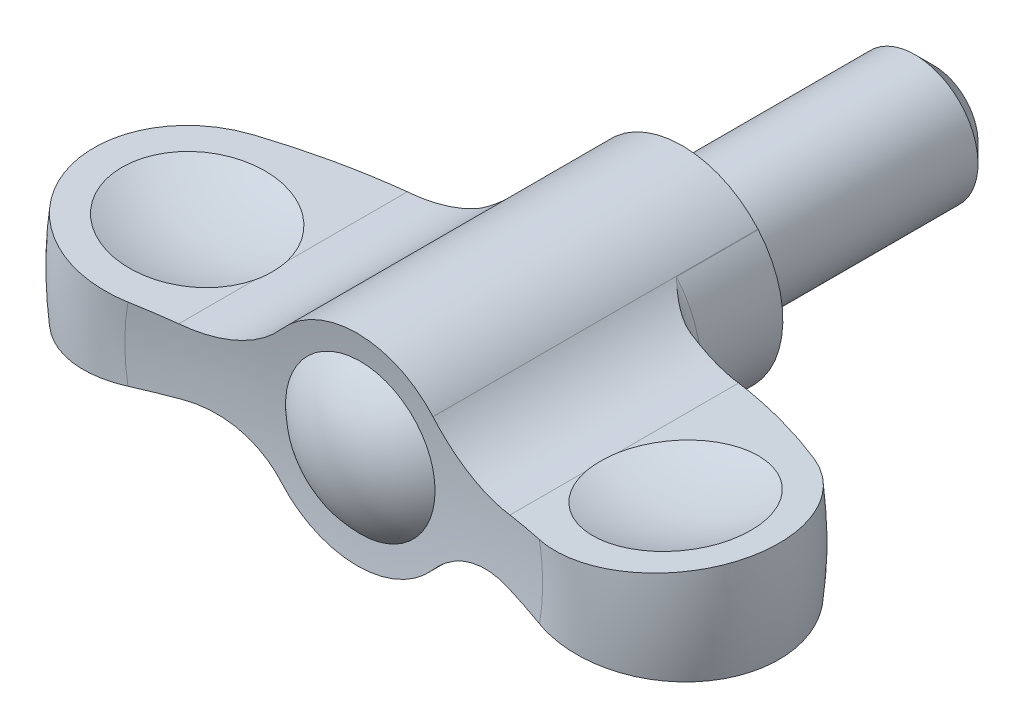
ISO-10303-21;
HEADER;
FILE_DESCRIPTION(('STEP AP214'),'2;1');
FILE_NAME('part.step','',(''),(''),'','','');
FILE_SCHEMA(('AUTOMOTIVE_DESIGN { 1 0 10303 214 1 1 1 1 }'));
ENDSEC;
DATA;
#1=APPLICATION_CONTEXT('core data for automotive mechanical design processes');
#2=APPLICATION_PROTOCOL_DEFINITION('international standard','automotive_design',2000,#1);
#3=PRODUCT_CONTEXT('',#1,'mechanical');
#4=PRODUCT('Part','Part','',(#3));
#5=PRODUCT_RELATED_PRODUCT_CATEGORY('part','',(#4));
#6=PRODUCT_DEFINITION_FORMATION('','',#4);
#7=PRODUCT_DEFINITION_CONTEXT('part definition',#1,'design');
#8=PRODUCT_DEFINITION('design','',#6,#7);
#9=PRODUCT_DEFINITION_SHAPE('','',#8);
#10=(LENGTH_UNIT() NAMED_UNIT(*) SI_UNIT(.MILLI.,.METRE.));
#11=(NAMED_UNIT(*) PLANE_ANGLE_UNIT() SI_UNIT($,.RADIAN.));
#12=(NAMED_UNIT(*) SI_UNIT($,.STERADIAN.) SOLID_ANGLE_UNIT());
#13=UNCERTAINTY_MEASURE_WITH_UNIT(LENGTH_MEASURE(1.E-05),#10,'distance_accuracy_value','');
#14=(GEOMETRIC_REPRESENTATION_CONTEXT(3) GLOBAL_UNCERTAINTY_ASSIGNED_CONTEXT((#13)) GLOBAL_UNIT_ASSIGNED_CONTEXT((#10,
#11,#12)) REPRESENTATION_CONTEXT('',''));
#15=CARTESIAN_POINT('',(0.,0.,0.));
#16=DIRECTION('',(0.,0.,1.));
#17=DIRECTION('',(1.,0.,0.));
#18=AXIS2_PLACEMENT_3D('',#15,#16,#17);
#19=CARTESIAN_POINT('',(0.,0.,6.5));
#20=DIRECTION('',(0.,0.,1.));
#21=DIRECTION('',(0.,-1.,0.));
#22=AXIS2_PLACEMENT_3D('',#19,#20,#21);
#23=TOROIDAL_SURFACE('',#22,9.4,1.40000000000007);
#24=DIRECTION('',(0.,0.,1.));
#25=VECTOR('',#24,1.);
#26=CARTESIAN_POINT('',(6.03890778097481,-5.2470556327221,-20.));
#27=LINE('',#26,#25);
#28=CARTESIAN_POINT('',(6.03890778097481,-5.24705563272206,6.5));
#29=VERTEX_POINT('',#28);
#30=CARTESIAN_POINT('',(6.03890778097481,-5.2470556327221,6.5021200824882));
#31=VERTEX_POINT('',#30);
#32=EDGE_CURVE('E178',#29,#31,#27,.T.);
#33=ORIENTED_EDGE('',*,*,#32,.F.);
#34=CARTESIAN_POINT('',(0.,0.,6.5));
#35=DIRECTION('',(0.,0.,1.));
#36=DIRECTION('',(0.,-1.,0.));
#37=AXIS2_PLACEMENT_3D('',#34,#35,#36);
#38=CIRCLE('',#37,8.);
#39=CARTESIAN_POINT('',(6.0470062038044,5.23772049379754,6.4999999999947));
#40=VERTEX_POINT('',#39);
#41=EDGE_CURVE('E299',#29,#40,#38,.T.);
#42=ORIENTED_EDGE('',*,*,#41,.T.);
#43=CARTESIAN_POINT('',(8.59708199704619,3.29504177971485,7.88661989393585));
#44=CARTESIAN_POINT('',(8.50944178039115,3.33729136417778,7.87729621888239));
#45=CARTESIAN_POINT('',(8.42307614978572,3.38091432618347,7.86348310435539));
#46=CARTESIAN_POINT('',(8.25334791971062,3.47048341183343,7.82827393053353));
#47=CARTESIAN_POINT('',(8.16997966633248,3.51642472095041,7.80689307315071));
#48=CARTESIAN_POINT('',(8.006927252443,3.6100455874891,7.75806975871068));
#49=CARTESIAN_POINT('',(7.92722117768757,3.65771052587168,7.73067131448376));
#50=CARTESIAN_POINT('',(7.77086822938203,3.75487699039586,7.67078020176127));
#51=CARTESIAN_POINT('',(7.69422278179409,3.80437935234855,7.6382851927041));
#52=CARTESIAN_POINT('',(7.51481068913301,3.9245724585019,7.55570149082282));
#53=CARTESIAN_POINT('',(7.41345025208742,3.996030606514,7.50367899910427));
#54=CARTESIAN_POINT('',(7.21620642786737,4.14190058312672,7.39355525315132));
#55=CARTESIAN_POINT('',(7.12032815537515,4.21631506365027,7.33544846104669));
#56=CARTESIAN_POINT('',(6.89765495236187,4.39723051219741,7.19147911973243));
#57=CARTESIAN_POINT('',(6.77323076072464,4.50501816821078,7.10356810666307));
#58=CARTESIAN_POINT('',(6.57394920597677,4.68848676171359,6.95337103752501));
#59=CARTESIAN_POINT('',(6.49659267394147,4.7626588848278,6.89250585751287));
#60=CARTESIAN_POINT('',(6.37240043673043,4.8865809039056,6.79132557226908));
#61=CARTESIAN_POINT('',(6.32451434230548,4.93561192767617,6.75141880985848));
#62=CARTESIAN_POINT('',(6.24744938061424,5.01656740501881,6.68590586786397));
#63=CARTESIAN_POINT('',(6.21784284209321,5.04817964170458,6.66041557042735));
#64=CARTESIAN_POINT('',(6.1701203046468,5.09997024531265,6.61881307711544));
#65=CARTESIAN_POINT('',(6.15183084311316,5.12002285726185,6.60274326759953));
#66=CARTESIAN_POINT('',(6.12231217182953,5.15271930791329,6.57655539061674));
#67=CARTESIAN_POINT('',(6.11100884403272,5.16531979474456,6.56646663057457));
#68=CARTESIAN_POINT('',(6.09275021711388,5.18580384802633,6.549990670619));
#69=CARTESIAN_POINT('',(6.08575717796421,5.19368060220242,6.54363714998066));
#70=CARTESIAN_POINT('',(6.07446460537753,5.20645064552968,6.53319636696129));
#71=CARTESIAN_POINT('',(6.07013806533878,5.21135545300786,6.52915239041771));
#72=CARTESIAN_POINT('',(6.06316395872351,5.21928103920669,6.52242537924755));
#73=CARTESIAN_POINT('',(6.06049083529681,5.22232358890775,6.51979601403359));
#74=CARTESIAN_POINT('',(6.05620285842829,5.22721145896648,6.51533355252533));
#75=CARTESIAN_POINT('',(6.05455913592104,5.22908696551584,6.51356171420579));
#76=CARTESIAN_POINT('',(6.05194270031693,5.23207504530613,6.51046552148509));
#77=CARTESIAN_POINT('',(6.05093886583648,5.23322217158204,6.50920550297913));
#78=CARTESIAN_POINT('',(6.04952852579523,5.23483466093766,6.50714224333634));
#79=CARTESIAN_POINT('',(6.04907130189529,5.23535757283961,6.50641962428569));
#80=CARTESIAN_POINT('',(6.04823146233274,5.23631829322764,6.50488003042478));
#81=CARTESIAN_POINT('',(6.04784824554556,5.23675678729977,6.50406390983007));
#82=CARTESIAN_POINT('',(6.04743475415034,5.2372299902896,6.50282878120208));
#83=CARTESIAN_POINT('',(6.04733123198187,5.23734847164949,6.50246832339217));
#84=CARTESIAN_POINT('',(6.04716301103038,5.23754100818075,6.50172769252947));
#85=CARTESIAN_POINT('',(6.04709815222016,5.23761524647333,6.50134760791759));
#86=CARTESIAN_POINT('',(6.04703697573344,5.23768527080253,6.50077037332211));
#87=CARTESIAN_POINT('',(6.04702259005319,5.23770173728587,6.50057747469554));
#88=CARTESIAN_POINT('',(6.0470060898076,5.23772062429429,6.50018965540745));
#89=CARTESIAN_POINT('',(6.04700402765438,5.23772298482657,6.49999472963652));
#90=CARTESIAN_POINT('',(6.0470084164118,5.23771796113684,6.49979999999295));
#91=B_SPLINE_CURVE_WITH_KNOTS('',3,(#43,#44,#45,#46,#47,#48,#49,#50,#51,#52,#53,#54,#55,#56,#57,
#58,#59,#60,#61,#62,#63,#64,#65,#66,#67,#68,#69,#70,#71,#72,#73,#74,#75,#76,#77,#78,#79,#80,#81,
#82,#83,#84,#85,#86,#87,#88,#89,#90),.UNSPECIFIED.,.F.,.F.,(4,2,2,2,2,2,2,2,2,2,2,2,2,2,2,2,2,2,
2,2,2,2,2,4),(0.,0.292919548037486,0.585253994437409,0.875517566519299,1.16591483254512,
1.56900991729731,1.97247513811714,2.53185645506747,2.90152662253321,3.1394263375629,
3.29018867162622,3.38481100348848,3.44392835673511,3.48083041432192,3.50389909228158,
3.51838177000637,3.52755772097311,3.53347737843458,3.53648190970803,3.53946090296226,
3.54063718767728,3.54180856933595,3.54239014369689,3.5429741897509),.UNSPECIFIED.);
#92=CARTESIAN_POINT('',(8.59520200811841,3.29594858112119,7.88641989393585));
#93=VERTEX_POINT('',#92);
#94=EDGE_CURVE('E445',#93,#40,#91,.T.);
#95=ORIENTED_EDGE('',*,*,#94,.F.);
#96=CARTESIAN_POINT('',(0.,0.,7.88641989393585));
#97=DIRECTION('',(0.,0.,1.));
#98=DIRECTION('',(0.,-1.,0.));
#99=AXIS2_PLACEMENT_3D('',#96,#97,#98);
#100=CIRCLE('',#99,9.20547525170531);
#101=CARTESIAN_POINT('',(8.59545916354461,-3.29527789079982,7.88641989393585));
#102=VERTEX_POINT('',#101);
#103=EDGE_CURVE('E300',#102,#93,#100,.T.);
#104=ORIENTED_EDGE('',*,*,#103,.F.);
#105=CARTESIAN_POINT('',(9.2464198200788,-3.01597169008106,7.86154869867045));
#106=CARTESIAN_POINT('',(9.191703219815,-3.03662617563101,7.87246212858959));
#107=CARTESIAN_POINT('',(9.13683292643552,-3.05803382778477,7.88088984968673));
#108=CARTESIAN_POINT('',(9.0272184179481,-3.10220967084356,7.89317258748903));
#109=CARTESIAN_POINT('',(8.97247413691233,-3.12497578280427,7.89703441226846));
#110=CARTESIAN_POINT('',(8.80995844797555,-3.19470660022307,7.90236716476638));
#111=CARTESIAN_POINT('',(8.70276195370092,-3.24353448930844,7.89779252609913));
#112=CARTESIAN_POINT('',(8.51047394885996,-3.33625869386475,7.87741400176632));
#113=CARTESIAN_POINT('',(8.42481297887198,-3.37951008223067,7.86372857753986));
#114=CARTESIAN_POINT('',(8.25627111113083,-3.46839491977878,7.82888132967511));
#115=CARTESIAN_POINT('',(8.17339149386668,-3.51402944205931,7.80771611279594));
#116=CARTESIAN_POINT('',(7.92832133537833,-3.65460006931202,7.73466741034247));
#117=CARTESIAN_POINT('',(7.77073045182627,-3.75270198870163,7.67337075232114));
#118=CARTESIAN_POINT('',(7.51219223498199,-3.92592329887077,7.55434149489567));
#119=CARTESIAN_POINT('',(7.40810830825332,-3.99942155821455,7.50076399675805));
#120=CARTESIAN_POINT('',(7.20573498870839,-4.14951628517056,7.38724676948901));
#121=CARTESIAN_POINT('',(7.10744753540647,-4.22611377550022,7.32730492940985));
#122=CARTESIAN_POINT('',(6.91648045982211,-4.38209339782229,7.20294133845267));
#123=CARTESIAN_POINT('',(6.82379096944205,-4.46147021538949,7.13852792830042));
#124=CARTESIAN_POINT('',(6.64338510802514,-4.62314447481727,7.00654560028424));
#125=CARTESIAN_POINT('',(6.55566785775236,-4.70544139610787,6.93897724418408));
#126=CARTESIAN_POINT('',(6.43300905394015,-4.82577735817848,6.84059313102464));
#127=CARTESIAN_POINT('',(6.39621820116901,-4.86258512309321,6.8105538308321));
#128=CARTESIAN_POINT('',(6.32347498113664,-4.93679114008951,6.75019039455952));
#129=CARTESIAN_POINT('',(6.28752259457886,-4.97418937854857,6.71986626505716));
#130=CARTESIAN_POINT('',(6.23420044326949,-5.03074553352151,6.67427938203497));
#131=CARTESIAN_POINT('',(6.21653276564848,-5.04966820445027,6.65907163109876));
#132=CARTESIAN_POINT('',(6.18141428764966,-5.08764734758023,6.62856921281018));
#133=CARTESIAN_POINT('',(6.16396349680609,-5.10670382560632,6.61327454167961));
#134=CARTESIAN_POINT('',(6.12918837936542,-5.14505447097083,6.58285648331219));
#135=CARTESIAN_POINT('',(6.11186402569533,-5.16434858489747,6.5677330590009));
#136=CARTESIAN_POINT('',(6.07769243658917,-5.20276831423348,6.53674407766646));
#137=CARTESIAN_POINT('',(6.06084502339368,-5.22189399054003,6.52087880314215));
#138=CARTESIAN_POINT('',(6.04125233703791,-5.24436286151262,6.50407138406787));
#139=CARTESIAN_POINT('',(6.03883132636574,-5.24714312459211,6.5020224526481));
#140=CARTESIAN_POINT('',(6.036402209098,-5.24993655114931,6.5));
#141=B_SPLINE_CURVE_WITH_KNOTS('',3,(#105,#106,#107,#108,#109,#110,#111,#112,#113,#114,#115,
#116,#117,#118,#119,#120,#121,#122,#123,#124,#125,#126,#127,#128,#129,#130,#131,#132,#133,#134,
#135,#136,#137,#138,#139,#140),.UNSPECIFIED.,.F.,.F.,(4,2,2,2,2,2,2,2,2,2,2,2,2,2,2,2,2,4),(0.,
0.178341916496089,0.356417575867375,0.708892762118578,0.999321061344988,1.28988128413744,
1.87442815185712,2.28884312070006,2.7033959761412,3.11719533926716,3.53092130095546,
3.71118323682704,3.89144102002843,3.98151493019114,4.07159278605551,4.16165075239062,
4.25167469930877,4.26432797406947),.UNSPECIFIED.);
#142=EDGE_CURVE('E316',#31,#102,#141,.F.);
#143=ORIENTED_EDGE('',*,*,#142,.F.);
#144=EDGE_LOOP('',(#33,#42,#95,#104,#143));
#145=FACE_BOUND('',#144,.T.);
#146=ADVANCED_FACE('F14',(#145),#23,.F.);
#147=CARTESIAN_POINT('',(7.9999999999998,0.,0.));
#148=DIRECTION('',(0.,0.,-1.));
#149=DIRECTION('',(0.,1.,0.));
#150=AXIS2_PLACEMENT_3D('',#147,#148,#149);
#151=PLANE('',#150);
#152=CARTESIAN_POINT('',(0.,0.,0.));
#153=DIRECTION('',(0.,0.,1.));
#154=DIRECTION('',(0.,-1.,0.));
#155=AXIS2_PLACEMENT_3D('',#152,#153,#154);
#156=CIRCLE('',#155,5.);
#157=CARTESIAN_POINT('',(0.,-5.,0.));
#158=VERTEX_POINT('',#157);
#159=EDGE_CURVE('E475',#158,#158,#156,.T.);
#160=ORIENTED_EDGE('',*,*,#159,.T.);
#161=EDGE_LOOP('',(#160));
#162=FACE_BOUND('',#161,.T.);
#163=CARTESIAN_POINT('',(12.0717114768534,10.5010774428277,0.));
#164=DIRECTION('',(0.,0.,-1.));
#165=DIRECTION('',(0.,1.,0.));
#166=AXIS2_PLACEMENT_3D('',#163,#164,#165);
#167=CIRCLE('',#166,8.);
#168=CARTESIAN_POINT('',(6.0470062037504,5.23772049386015,0.));
#169=VERTEX_POINT('',#168);
#170=CARTESIAN_POINT('',(6.02470527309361,5.26335694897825,0.));
#171=VERTEX_POINT('',#170);
#172=EDGE_CURVE('E454',#169,#171,#167,.T.);
#173=ORIENTED_EDGE('',*,*,#172,.F.);
#174=CARTESIAN_POINT('',(0.,0.,0.));
#175=DIRECTION('',(0.,0.,1.));
#176=DIRECTION('',(0.,-1.,0.));
#177=AXIS2_PLACEMENT_3D('',#174,#175,#176);
#178=CIRCLE('',#177,8.);
#179=CARTESIAN_POINT('',(-6.04700620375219,5.23772049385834,0.));
#180=VERTEX_POINT('',#179);
#181=EDGE_CURVE('E472',#180,#169,#178,.T.);
#182=ORIENTED_EDGE('',*,*,#181,.F.);
#183=CARTESIAN_POINT('',(-12.0717114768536,10.5010774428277,0.));
#184=DIRECTION('',(0.,0.,-1.));
#185=DIRECTION('',(0.,1.,0.));
#186=AXIS2_PLACEMENT_3D('',#183,#184,#185);
#187=CIRCLE('',#186,8.);
#188=CARTESIAN_POINT('',(-6.0247052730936,5.26335694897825,0.));
#189=VERTEX_POINT('',#188);
#190=EDGE_CURVE('E521',#180,#189,#187,.F.);
#191=ORIENTED_EDGE('',*,*,#190,.T.);
#192=EDGE_CURVE('E471',#171,#189,#178,.T.);
#193=ORIENTED_EDGE('',*,*,#192,.F.);
#194=EDGE_LOOP('',(#173,#182,#191,#193));
#195=FACE_BOUND('',#194,.T.);
#196=ADVANCED_FACE('F268',(#162,#195),#151,.T.);
#197=CARTESIAN_POINT('',(0.,0.,32.9780362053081));
#198=DIRECTION('',(0.,0.,1.));
#199=DIRECTION('',(0.,-1.,0.));
#200=AXIS2_PLACEMENT_3D('',#197,#198,#199);
#201=CYLINDRICAL_SURFACE('',#200,8.);
#202=DIRECTION('',(0.,0.,1.));
#203=VECTOR('',#202,1.);
#204=CARTESIAN_POINT('',(-6.0247052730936,5.26335694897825,-20.));
#205=LINE('',#204,#203);
#206=CARTESIAN_POINT('',(-6.0247052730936,5.26335694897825,25.8131362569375));
#207=VERTEX_POINT('',#206);
#208=EDGE_CURVE('E162',#189,#207,#205,.T.);
#209=ORIENTED_EDGE('',*,*,#208,.T.);
#210=CARTESIAN_POINT('',(0.,0.,25.8131362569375));
#211=DIRECTION('',(0.,0.,1.));
#212=DIRECTION('',(0.,-1.,0.));
#213=AXIS2_PLACEMENT_3D('',#210,#211,#212);
#214=CIRCLE('',#213,8.);
#215=CARTESIAN_POINT('',(6.02470527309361,5.26335694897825,25.8131362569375));
#216=VERTEX_POINT('',#215);
#217=EDGE_CURVE('E477',#216,#207,#214,.T.);
#218=ORIENTED_EDGE('',*,*,#217,.F.);
#219=DIRECTION('',(0.,0.,1.));
#220=VECTOR('',#219,1.);
#221=CARTESIAN_POINT('',(6.02470527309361,5.26335694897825,-20.));
#222=LINE('',#221,#220);
#223=EDGE_CURVE('E165',#171,#216,#222,.T.);
#224=ORIENTED_EDGE('',*,*,#223,.F.);
#225=ORIENTED_EDGE('',*,*,#192,.T.);
#226=EDGE_LOOP('',(#209,#218,#224,#225));
#227=FACE_BOUND('',#226,.T.);
#228=ADVANCED_FACE('F275',(#227),#201,.T.);
#229=DIRECTION('',(0.,0.,1.));
#230=VECTOR('',#229,1.);
#231=CARTESIAN_POINT('',(-6.04700620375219,5.23772049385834,3.25));
#232=LINE('',#231,#230);
#233=CARTESIAN_POINT('',(-6.04700620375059,5.23772049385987,6.5));
#234=VERTEX_POINT('',#233);
#235=EDGE_CURVE('E523',#180,#234,#232,.T.);
#236=ORIENTED_EDGE('',*,*,#235,.F.);
#237=ORIENTED_EDGE('',*,*,#181,.T.);
#238=DIRECTION('',(0.,0.,1.));
#239=VECTOR('',#238,1.);
#240=CARTESIAN_POINT('',(6.0470062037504,5.23772049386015,3.25));
#241=LINE('',#240,#239);
#242=EDGE_CURVE('E451',#169,#40,#241,.T.);
#243=ORIENTED_EDGE('',*,*,#242,.T.);
#244=ORIENTED_EDGE('',*,*,#41,.F.);
#245=ORIENTED_EDGE('',*,*,#32,.T.);
#246=CARTESIAN_POINT('',(6.03890778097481,-5.2470556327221,25.8131362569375));
#247=VERTEX_POINT('',#246);
#248=EDGE_CURVE('E175',#31,#247,#27,.T.);
#249=ORIENTED_EDGE('',*,*,#248,.T.);
#250=CARTESIAN_POINT('',(0.,0.,25.8131362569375));
#251=DIRECTION('',(0.,0.,1.));
#252=DIRECTION('',(0.,-1.,0.));
#253=AXIS2_PLACEMENT_3D('',#250,#251,#252);
#254=CIRCLE('',#253,8.);
#255=CARTESIAN_POINT('',(-6.0389077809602,-5.24705563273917,25.8131362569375));
#256=VERTEX_POINT('',#255);
#257=EDGE_CURVE('E304',#256,#247,#254,.T.);
#258=ORIENTED_EDGE('',*,*,#257,.F.);
#259=DIRECTION('',(0.,0.,1.));
#260=VECTOR('',#259,1.);
#261=CARTESIAN_POINT('',(-6.03890778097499,-5.2470556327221,-20.));
#262=LINE('',#261,#260);
#263=CARTESIAN_POINT('',(-6.03890778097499,-5.2470556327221,6.5021200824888));
#264=VERTEX_POINT('',#263);
#265=EDGE_CURVE('E171',#264,#256,#262,.T.);
#266=ORIENTED_EDGE('',*,*,#265,.F.);
#267=CARTESIAN_POINT('',(-6.03890778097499,-5.24705563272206,6.5));
#268=VERTEX_POINT('',#267);
#269=EDGE_CURVE('E174',#268,#264,#262,.T.);
#270=ORIENTED_EDGE('',*,*,#269,.F.);
#271=EDGE_CURVE('E294',#234,#268,#38,.T.);
#272=ORIENTED_EDGE('',*,*,#271,.F.);
#273=EDGE_LOOP('',(#236,#237,#243,#244,#245,#249,#258,#266,#270,#272));
#274=FACE_BOUND('',#273,.T.);
#275=ADVANCED_FACE('F282',(#274),#201,.T.);
#276=ORIENTED_EDGE('',*,*,#271,.T.);
#277=ORIENTED_EDGE('',*,*,#269,.T.);
#278=CARTESIAN_POINT('',(-9.246419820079,-3.01597169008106,7.86154869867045));
#279=CARTESIAN_POINT('',(-9.19170321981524,-3.03662617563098,7.87246212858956));
#280=CARTESIAN_POINT('',(-9.1368329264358,-3.05803382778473,7.88088984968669));
#281=CARTESIAN_POINT('',(-9.02721841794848,-3.10220967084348,7.89317258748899));
#282=CARTESIAN_POINT('',(-8.97247413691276,-3.12497578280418,7.89703441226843));
#283=CARTESIAN_POINT('',(-8.80995844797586,-3.19470660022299,7.9023671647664));
#284=CARTESIAN_POINT('',(-8.70276195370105,-3.24353448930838,7.89779252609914));
#285=CARTESIAN_POINT('',(-8.51047394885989,-3.33625869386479,7.87741400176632));
#286=CARTESIAN_POINT('',(-8.42481297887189,-3.37951008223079,7.86372857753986));
#287=CARTESIAN_POINT('',(-8.25627111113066,-3.46839491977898,7.82888132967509));
#288=CARTESIAN_POINT('',(-8.17339149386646,-3.51402944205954,7.80771611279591));
#289=CARTESIAN_POINT('',(-7.92832133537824,-3.65460006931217,7.73466741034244));
#290=CARTESIAN_POINT('',(-7.77073045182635,-3.75270198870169,7.67337075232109));
#291=CARTESIAN_POINT('',(-7.51219223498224,-3.92592329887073,7.55434149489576));
#292=CARTESIAN_POINT('',(-7.40810830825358,-3.99942155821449,7.50076399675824));
#293=CARTESIAN_POINT('',(-7.20573498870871,-4.14951628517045,7.38724676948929));
#294=CARTESIAN_POINT('',(-7.10744753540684,-4.22611377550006,7.32730492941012));
#295=CARTESIAN_POINT('',(-6.91648045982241,-4.38209339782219,7.20294133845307));
#296=CARTESIAN_POINT('',(-6.82379096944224,-4.46147021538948,7.13852792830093));
#297=CARTESIAN_POINT('',(-6.64338510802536,-4.62314447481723,7.00654560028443));
#298=CARTESIAN_POINT('',(-6.5556678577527,-4.7054413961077,6.93897724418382));
#299=CARTESIAN_POINT('',(-6.43300905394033,-4.82577735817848,6.84059313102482));
#300=CARTESIAN_POINT('',(-6.39621820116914,-4.86258512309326,6.81055383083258));
#301=CARTESIAN_POINT('',(-6.3234749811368,-4.93679114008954,6.75019039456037));
#302=CARTESIAN_POINT('',(-6.28752259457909,-4.97418937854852,6.71986626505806));
#303=CARTESIAN_POINT('',(-6.23420044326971,-5.03074553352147,6.6742793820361));
#304=CARTESIAN_POINT('',(-6.21653276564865,-5.04966820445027,6.65907163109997));
#305=CARTESIAN_POINT('',(-6.18141428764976,-5.08764734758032,6.62856921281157));
#306=CARTESIAN_POINT('',(-6.16396349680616,-5.10670382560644,6.61327454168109));
#307=CARTESIAN_POINT('',(-6.12918837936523,-5.14505447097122,6.58285648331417));
#308=CARTESIAN_POINT('',(-6.11186402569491,-5.1643485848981,6.56773305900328));
#309=CARTESIAN_POINT('',(-6.07769243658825,-5.20276831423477,6.53674407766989));
#310=CARTESIAN_POINT('',(-6.06084502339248,-5.22189399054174,6.52087880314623));
#311=CARTESIAN_POINT('',(-6.04125233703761,-5.24436286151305,6.50407138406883));
#312=CARTESIAN_POINT('',(-6.03883132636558,-5.24714312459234,6.50202245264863));
#313=CARTESIAN_POINT('',(-6.036402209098,-5.2499365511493,6.5));
#314=B_SPLINE_CURVE_WITH_KNOTS('',3,(#278,#279,#280,#281,#282,#283,#284,#285,#286,#287,#288,
#289,#290,#291,#292,#293,#294,#295,#296,#297,#298,#299,#300,#301,#302,#303,#304,#305,#306,#307,
#308,#309,#310,#311,#312,#313),.UNSPECIFIED.,.F.,.F.,(4,2,2,2,2,2,2,2,2,2,2,2,2,2,2,2,2,4),(0.,
0.178341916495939,0.356417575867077,0.708892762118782,0.999321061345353,1.28988128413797,
1.8744281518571,2.28884312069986,2.70339597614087,3.11719533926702,3.53092130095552,
3.71118323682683,3.89144102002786,3.98151493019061,4.07159278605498,4.16165075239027,
4.25167469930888,4.2643279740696),.UNSPECIFIED.);
#315=CARTESIAN_POINT('',(-8.59545916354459,-3.29527789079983,7.88641989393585));
#316=VERTEX_POINT('',#315);
#317=EDGE_CURVE('E311',#264,#316,#314,.F.);
#318=ORIENTED_EDGE('',*,*,#317,.T.);
#319=CARTESIAN_POINT('',(-8.5952020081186,3.29594858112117,7.88641989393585));
#320=VERTEX_POINT('',#319);
#321=EDGE_CURVE('E467',#320,#316,#100,.T.);
#322=ORIENTED_EDGE('',*,*,#321,.F.);
#323=CARTESIAN_POINT('',(-8.59708199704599,3.29504177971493,7.88661989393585));
#324=CARTESIAN_POINT('',(-8.50944178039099,3.33729136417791,7.87729621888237));
#325=CARTESIAN_POINT('',(-8.42307614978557,3.38091432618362,7.86348310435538));
#326=CARTESIAN_POINT('',(-8.25334791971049,3.47048341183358,7.82827393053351));
#327=CARTESIAN_POINT('',(-8.16997966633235,3.51642472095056,7.80689307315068));
#328=CARTESIAN_POINT('',(-8.00692725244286,3.61004558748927,7.75806975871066));
#329=CARTESIAN_POINT('',(-7.92722117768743,3.65771052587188,7.73067131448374));
#330=CARTESIAN_POINT('',(-7.77086822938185,3.75487699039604,7.67078020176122));
#331=CARTESIAN_POINT('',(-7.69422278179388,3.80437935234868,7.63828519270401));
#332=CARTESIAN_POINT('',(-7.51481068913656,3.92457245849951,7.55570149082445));
#333=CARTESIAN_POINT('',(-7.41345025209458,3.99603060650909,7.50367899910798));
#334=CARTESIAN_POINT('',(-7.21620642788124,4.14190058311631,7.39355525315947));
#335=CARTESIAN_POINT('',(-7.12032815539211,4.2163150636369,7.33544846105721));
#336=CARTESIAN_POINT('',(-6.8976549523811,4.39723051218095,7.19147911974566));
#337=CARTESIAN_POINT('',(-6.77323076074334,4.50501816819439,7.1035681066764));
#338=CARTESIAN_POINT('',(-6.57394920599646,4.68848676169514,6.95337103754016));
#339=CARTESIAN_POINT('',(-6.49659267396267,4.76265888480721,6.89250585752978));
#340=CARTESIAN_POINT('',(-6.37240043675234,4.88658090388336,6.7913255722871));
#341=CARTESIAN_POINT('',(-6.32451434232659,4.93561192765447,6.7514188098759));
#342=CARTESIAN_POINT('',(-6.24744938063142,5.01656740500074,6.68590586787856));
#343=CARTESIAN_POINT('',(-6.21784284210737,5.04817964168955,6.66041557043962));
#344=CARTESIAN_POINT('',(-6.17012030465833,5.09997024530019,6.61881307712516));
#345=CARTESIAN_POINT('',(-6.1518308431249,5.12002285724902,6.60274326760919));
#346=CARTESIAN_POINT('',(-6.12231217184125,5.15271930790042,6.57655539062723));
#347=CARTESIAN_POINT('',(-6.11100884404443,5.16531979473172,6.56646663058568));
#348=CARTESIAN_POINT('',(-6.09275021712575,5.1858038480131,6.54999067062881));
#349=CARTESIAN_POINT('',(-6.08575717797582,5.19368060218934,6.54363714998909));
#350=CARTESIAN_POINT('',(-6.07446460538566,5.20645064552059,6.53319636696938));
#351=CARTESIAN_POINT('',(-6.07013806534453,5.21135545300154,6.52915239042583));
#352=CARTESIAN_POINT('',(-6.06316395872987,5.21928103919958,6.52242537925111));
#353=CARTESIAN_POINT('',(-6.06049083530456,5.22232358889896,6.51979601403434));
#354=CARTESIAN_POINT('',(-6.05620285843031,5.22721145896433,6.51533355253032));
#355=CARTESIAN_POINT('',(-6.05455913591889,5.22908696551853,6.51356171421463));
#356=CARTESIAN_POINT('',(-6.05194270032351,5.23207504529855,6.51046552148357));
#357=CARTESIAN_POINT('',(-6.05093886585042,5.23322217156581,6.50920550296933));
#358=CARTESIAN_POINT('',(-6.04952852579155,5.23483466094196,6.5071422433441));
#359=CARTESIAN_POINT('',(-6.0490713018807,5.23535757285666,6.50641962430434));
#360=CARTESIAN_POINT('',(-6.04823146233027,5.23631829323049,6.50488003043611));
#361=CARTESIAN_POINT('',(-6.04784824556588,5.23675678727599,6.50406390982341));
#362=CARTESIAN_POINT('',(-6.04743475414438,5.23722999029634,6.50282878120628));
#363=CARTESIAN_POINT('',(-6.04733123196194,5.23734847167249,6.50246832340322));
#364=CARTESIAN_POINT('',(-6.04716301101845,5.23754100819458,6.50172769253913));
#365=CARTESIAN_POINT('',(-6.04709815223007,5.23761524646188,6.50134760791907));
#366=CARTESIAN_POINT('',(-6.04703697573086,5.23768527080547,6.5007703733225));
#367=CARTESIAN_POINT('',(-6.04702259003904,5.23770173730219,6.50057747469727));
#368=CARTESIAN_POINT('',(-6.04700608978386,5.23772062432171,6.50018965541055));
#369=CARTESIAN_POINT('',(-6.04700402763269,5.23772298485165,6.49999472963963));
#370=CARTESIAN_POINT('',(-6.0470084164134,5.23771796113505,6.49979999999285));
#371=B_SPLINE_CURVE_WITH_KNOTS('',3,(#323,#324,#325,#326,#327,#328,#329,#330,#331,#332,#333,
#334,#335,#336,#337,#338,#339,#340,#341,#342,#343,#344,#345,#346,#347,#348,#349,#350,#351,#352,
#353,#354,#355,#356,#357,#358,#359,#360,#361,#362,#363,#364,#365,#366,#367,#368,#369,#370),
.UNSPECIFIED.,.F.,.F.,(4,2,2,2,2,2,2,2,2,2,2,2,2,2,2,2,2,2,2,2,2,2,2,4),(0.,0.292919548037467,
0.58525399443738,0.875517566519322,1.16591483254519,1.56900991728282,1.97247513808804,
2.53185645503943,2.90152662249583,3.13942633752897,3.29018867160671,3.38481100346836,
3.44392835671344,3.48083041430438,3.503899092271,3.51838176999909,3.52755772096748,
3.53347737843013,3.53648190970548,3.53946090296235,3.54063718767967,3.54180856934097,
3.54239014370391,3.54297418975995),.UNSPECIFIED.);
#372=EDGE_CURVE('E194',#320,#234,#371,.T.);
#373=ORIENTED_EDGE('',*,*,#372,.T.);
#374=EDGE_LOOP('',(#276,#277,#318,#322,#373));
#375=FACE_BOUND('',#374,.T.);
#376=ADVANCED_FACE('F270',(#375),#23,.F.);
#377=CARTESIAN_POINT('',(0.,0.,55.408674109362));
#378=DIRECTION('',(0.,0.,1.));
#379=DIRECTION('',(0.,-1.,0.));
#380=AXIS2_PLACEMENT_3D('',#377,#378,#379);
#381=DEGENERATE_TOROIDAL_SURFACE('',#380,2.53775894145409,47.9877389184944,.T.);
#382=ORIENTED_EDGE('',*,*,#103,.T.);
#383=CARTESIAN_POINT('',(5.40789714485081,6.07461400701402,7.74825077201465));
#384=CARTESIAN_POINT('',(5.5291773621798,5.89198502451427,7.7417150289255));
#385=CARTESIAN_POINT('',(5.65803975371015,5.71432205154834,7.7372582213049));
#386=CARTESIAN_POINT('',(5.92992964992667,5.37014226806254,7.7324895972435));
#387=CARTESIAN_POINT('',(6.07295642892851,5.2036248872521,7.73217756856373));
#388=CARTESIAN_POINT('',(6.37210580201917,4.88302009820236,7.73568398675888));
#389=CARTESIAN_POINT('',(6.52822111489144,4.72892587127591,7.73950015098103));
#390=CARTESIAN_POINT('',(6.85248447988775,4.43414479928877,7.75130368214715));
#391=CARTESIAN_POINT('',(7.02063240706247,4.29345781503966,7.75929100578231));
#392=CARTESIAN_POINT('',(7.36839276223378,4.02596374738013,7.77954568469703));
#393=CARTESIAN_POINT('',(7.54804576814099,3.89921061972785,7.79182895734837));
#394=CARTESIAN_POINT('',(7.9169239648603,3.66105266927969,7.82074605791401));
#395=CARTESIAN_POINT('',(8.10614934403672,3.54964814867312,7.83737997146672));
#396=CARTESIAN_POINT('',(8.49266533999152,3.34297499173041,7.87504105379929));
#397=CARTESIAN_POINT('',(8.68995161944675,3.24769781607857,7.89606588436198));
#398=CARTESIAN_POINT('',(9.09122637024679,3.07379499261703,7.94252339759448));
#399=CARTESIAN_POINT('',(9.29521479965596,2.99516924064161,7.96795605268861));
#400=CARTESIAN_POINT('',(9.70845663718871,2.854990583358,8.02319155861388));
#401=CARTESIAN_POINT('',(9.91771139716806,2.79344211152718,8.05299554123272));
#402=CARTESIAN_POINT('',(10.3400150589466,2.68771529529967,8.11688005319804));
#403=CARTESIAN_POINT('',(10.5530655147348,2.64354424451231,8.15096237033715));
#404=CARTESIAN_POINT('',(10.9815499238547,2.57272696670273,8.22326754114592));
#405=CARTESIAN_POINT('',(11.1969857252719,2.54609545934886,8.2614938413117));
#406=CARTESIAN_POINT('',(11.6284903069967,2.51043256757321,8.34184151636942));
#407=CARTESIAN_POINT('',(11.844558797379,2.50139409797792,8.38396131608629));
#408=CARTESIAN_POINT('',(12.2806577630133,2.50077046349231,8.47281848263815));
#409=CARTESIAN_POINT('',(12.5006723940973,2.50956853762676,8.51963625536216));
#410=CARTESIAN_POINT('',(12.9384709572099,2.54513800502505,8.6167995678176));
#411=CARTESIAN_POINT('',(13.156254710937,2.57191082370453,8.66714538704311));
#412=CARTESIAN_POINT('',(13.5879515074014,2.6430363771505,8.77098851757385));
#413=CARTESIAN_POINT('',(13.8018678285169,2.68737341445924,8.82448297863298));
#414=CARTESIAN_POINT('',(14.2246542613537,2.79313397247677,8.93430204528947));
#415=CARTESIAN_POINT('',(14.4335251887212,2.85455471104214,8.99062618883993));
#416=CARTESIAN_POINT('',(14.6392212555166,2.92427775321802,9.04819298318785));
#417=B_SPLINE_CURVE_WITH_KNOTS('',3,(#383,#384,#385,#386,#387,#388,#389,#390,#391,#392,#393,
#394,#395,#396,#397,#398,#399,#400,#401,#402,#403,#404,#405,#406,#407,#408,#409,#410,#411,#412,
#413,#414,#415,#416),.UNSPECIFIED.,.F.,.F.,(4,2,2,2,2,2,2,2,2,2,2,2,2,2,2,2,4),(0.,
0.657784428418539,1.31553517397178,1.9729224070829,2.63030281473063,3.2901452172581,
3.95000060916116,4.60950551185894,5.26900628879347,5.92867812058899,6.58862653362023,
7.24912809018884,7.90936359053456,8.58393530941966,9.25856052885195,9.93258417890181,
10.6064981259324),.UNSPECIFIED.);
#418=CARTESIAN_POINT('',(13.1528156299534,2.57446317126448,8.66701618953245));
#419=VERTEX_POINT('',#418);
#420=EDGE_CURVE('E438',#93,#419,#417,.T.);
#421=ORIENTED_EDGE('',*,*,#420,.T.);
#422=CARTESIAN_POINT('',(13.1526156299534,2.57444288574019,8.66696966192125));
#423=CARTESIAN_POINT('',(13.9370340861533,2.65400458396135,8.8494335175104));
#424=CARTESIAN_POINT('',(14.7168563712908,2.73310010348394,9.05185397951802));
#425=CARTESIAN_POINT('',(16.2633623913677,2.88995853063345,9.49546553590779));
#426=CARTESIAN_POINT('',(17.0300745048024,2.96772431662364,9.73655668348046));
#427=CARTESIAN_POINT('',(18.5504261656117,3.12192996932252,10.2573018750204));
#428=CARTESIAN_POINT('',(19.3040656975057,3.19836983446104,10.5369559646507));
#429=CARTESIAN_POINT('',(20.7982632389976,3.34992273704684,11.134858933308));
#430=CARTESIAN_POINT('',(21.5387829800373,3.4250318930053,11.4532044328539));
#431=CARTESIAN_POINT('',(22.2708092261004,3.49927957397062,11.7901956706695));
#432=B_SPLINE_CURVE_WITH_KNOTS('',3,(#422,#423,#424,#425,#426,#427,#428,#429,#430,#431),
.UNSPECIFIED.,.F.,.F.,(4,2,2,2,4),(0.,2.42758220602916,4.84898838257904,7.27039742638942,
9.69798251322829),.UNSPECIFIED.);
#433=CARTESIAN_POINT('',(22.2703747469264,3.49923550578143,11.7899956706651));
#434=VERTEX_POINT('',#433);
#435=EDGE_CURVE('E431',#419,#434,#432,.T.);
#436=ORIENTED_EDGE('',*,*,#435,.T.);
#437=CARTESIAN_POINT('',(0.,0.,11.7899956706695));
#438=DIRECTION('',(0.,0.,1.));
#439=DIRECTION('',(0.,-1.,0.));
#440=AXIS2_PLACEMENT_3D('',#437,#438,#439);
#441=CIRCLE('',#440,22.5436075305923);
#442=CARTESIAN_POINT('',(22.2706216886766,-3.49766351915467,11.7899956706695));
#443=VERTEX_POINT('',#442);
#444=EDGE_CURVE('E464',#443,#434,#441,.T.);
#445=ORIENTED_EDGE('',*,*,#444,.F.);
#446=CARTESIAN_POINT('',(12.9962083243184,-2.55398166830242,8.63065853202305));
#447=CARTESIAN_POINT('',(13.7943446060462,-2.63519292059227,8.81347846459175));
#448=CARTESIAN_POINT('',(14.5877985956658,-2.71592774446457,9.01694513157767));
#449=CARTESIAN_POINT('',(16.1611919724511,-2.87602226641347,9.46398142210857));
#450=CARTESIAN_POINT('',(16.9411614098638,-2.95538502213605,9.70744418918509));
#451=CARTESIAN_POINT('',(18.4876557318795,-3.11274253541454,10.2342505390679));
#452=CARTESIAN_POINT('',(19.2541805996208,-3.19073729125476,10.5175941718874));
#453=CARTESIAN_POINT('',(20.7737763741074,-3.34535784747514,11.1241962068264));
#454=CARTESIAN_POINT('',(21.5268064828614,-3.42197949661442,11.4475578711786));
#455=CARTESIAN_POINT('',(22.271056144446,-3.4977077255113,11.7901956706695));
#456=B_SPLINE_CURVE_WITH_KNOTS('',3,(#446,#447,#448,#449,#450,#451,#452,#453,#454,#455),
.UNSPECIFIED.,.F.,.F.,(4,2,2,2,4),(0.,2.46819948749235,4.92990890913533,7.3916214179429,
9.85982400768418),.UNSPECIFIED.);
#457=CARTESIAN_POINT('',(12.9964083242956,-2.5540020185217,8.63070434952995));
#458=VERTEX_POINT('',#457);
#459=EDGE_CURVE('E414',#458,#443,#456,.T.);
#460=ORIENTED_EDGE('',*,*,#459,.F.);
#461=CARTESIAN_POINT('',(5.40816196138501,-6.0746786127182,7.7482771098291));
#462=CARTESIAN_POINT('',(5.52938177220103,-5.89205626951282,7.74173743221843));
#463=CARTESIAN_POINT('',(5.65818351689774,-5.7143974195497,7.73727619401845));
#464=CARTESIAN_POINT('',(5.92995209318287,-5.37022086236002,7.73249766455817));
#465=CARTESIAN_POINT('',(6.07291819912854,-5.20370258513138,7.7321801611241));
#466=CARTESIAN_POINT('',(6.37194671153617,-4.88309096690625,7.73567453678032));
#467=CARTESIAN_POINT('',(6.52800183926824,-4.72899081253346,7.73948413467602));
#468=CARTESIAN_POINT('',(6.85214571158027,-4.43419295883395,7.75127335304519));
#469=CARTESIAN_POINT('',(7.02023433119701,-4.29349512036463,7.75925293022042));
#470=CARTESIAN_POINT('',(7.36787685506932,-4.02597472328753,7.77949081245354));
#471=CARTESIAN_POINT('',(7.54747132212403,-3.89920607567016,7.79176502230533));
#472=CARTESIAN_POINT('',(7.91623418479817,-3.66101233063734,7.82066267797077));
#473=CARTESIAN_POINT('',(8.10540276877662,-3.54958753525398,7.83728620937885));
#474=CARTESIAN_POINT('',(8.49180737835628,-3.34286928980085,7.87492522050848));
#475=CARTESIAN_POINT('',(8.68903906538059,-3.24756730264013,7.89593836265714));
#476=CARTESIAN_POINT('',(9.09020720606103,-3.0736105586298,7.94237123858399));
#477=CARTESIAN_POINT('',(9.29414361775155,-2.99495569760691,7.96779094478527));
#478=CARTESIAN_POINT('',(9.70728411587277,-2.85471488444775,8.02299934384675));
#479=CARTESIAN_POINT('',(9.91648954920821,-2.79313334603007,8.05278916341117));
#480=CARTESIAN_POINT('',(10.3386977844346,-2.68733665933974,8.11664426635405));
#481=CARTESIAN_POINT('',(10.5517021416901,-2.6431288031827,8.15071133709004));
#482=CARTESIAN_POINT('',(10.980097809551,-2.57223450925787,8.22298504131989));
#483=CARTESIAN_POINT('',(11.1954909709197,-2.5455627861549,8.26119511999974));
#484=CARTESIAN_POINT('',(11.6269140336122,-2.50981645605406,8.34150952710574));
#485=CARTESIAN_POINT('',(11.8429436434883,-2.5007347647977,8.38361228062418));
#486=CARTESIAN_POINT('',(12.2789655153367,-2.50002106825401,8.4724337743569));
#487=CARTESIAN_POINT('',(12.4989420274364,-2.50877204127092,8.51923286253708));
#488=CARTESIAN_POINT('',(12.9366686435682,-2.5442445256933,8.61635812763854));
#489=CARTESIAN_POINT('',(13.1544185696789,-2.57096746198,8.66668458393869));
#490=CARTESIAN_POINT('',(13.5860522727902,-2.6419909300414,8.77048849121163));
#491=CARTESIAN_POINT('',(13.7999393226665,-2.68627577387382,8.82396309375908));
#492=CARTESIAN_POINT('',(14.2226717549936,-2.79192997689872,8.93374204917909));
#493=CARTESIAN_POINT('',(14.4315179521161,-2.85329655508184,8.99004594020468));
#494=CARTESIAN_POINT('',(14.6371915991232,-2.92296463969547,9.04759234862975));
#495=B_SPLINE_CURVE_WITH_KNOTS('',3,(#461,#462,#463,#464,#465,#466,#467,#468,#469,#470,#471,
#472,#473,#474,#475,#476,#477,#478,#479,#480,#481,#482,#483,#484,#485,#486,#487,#488,#489,#490,
#491,#492,#493,#494),.UNSPECIFIED.,.F.,.F.,(4,2,2,2,2,2,2,2,2,2,2,2,2,2,2,2,4),(0.,
0.657668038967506,1.31530240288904,1.97257345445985,2.62983768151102,3.28956225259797,
3.9492998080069,4.60868692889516,5.26806992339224,5.92762322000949,6.58745305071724,
7.24783584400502,7.90795261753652,8.58239553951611,9.25689194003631,9.93078716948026,
10.6045727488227),.UNSPECIFIED.);
#496=EDGE_CURVE('E314',#458,#102,#495,.F.);
#497=ORIENTED_EDGE('',*,*,#496,.T.);
#498=EDGE_LOOP('',(#382,#421,#436,#445,#460,#497));
#499=FACE_BOUND('',#498,.T.);
#500=ADVANCED_FACE('F281',(#499),#381,.T.);
#501=CARTESIAN_POINT('',(0.,0.,19.5161101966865));
#502=DIRECTION('',(0.,0.,1.));
#503=DIRECTION('',(0.,-1.,0.));
#504=AXIS2_PLACEMENT_3D('',#501,#502,#503);
#505=TOROIDAL_SURFACE('',#504,19.,8.5);
#506=CARTESIAN_POINT('',(0.,0.,27.6698599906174));
#507=DIRECTION('',(0.,0.,1.));
#508=DIRECTION('',(0.,-1.,0.));
#509=AXIS2_PLACEMENT_3D('',#506,#507,#508);
#510=CIRCLE('',#509,16.5986744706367);
#511=CARTESIAN_POINT('',(16.3443249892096,-2.89465625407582,27.6698599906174));
#512=VERTEX_POINT('',#511);
#513=CARTESIAN_POINT('',(16.3437132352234,2.89810832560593,27.6698599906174));
#514=VERTEX_POINT('',#513);
#515=EDGE_CURVE('E460',#512,#514,#510,.T.);
#516=ORIENTED_EDGE('',*,*,#515,.F.);
#517=CARTESIAN_POINT('',(22.2701871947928,-3.49761930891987,11.7897956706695));
#518=CARTESIAN_POINT('',(22.4865890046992,-3.51963843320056,11.8893708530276));
#519=CARTESIAN_POINT('',(22.6987916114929,-3.54123028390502,11.9981566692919));
#520=CARTESIAN_POINT('',(23.1133331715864,-3.5834103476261,12.2332797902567));
#521=CARTESIAN_POINT('',(23.3156725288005,-3.60399860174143,12.359616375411));
#522=CARTESIAN_POINT('',(23.7089103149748,-3.64401098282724,12.6288905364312));
#523=CARTESIAN_POINT('',(23.8998162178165,-3.66343587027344,12.771817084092));
#524=CARTESIAN_POINT('',(24.2689734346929,-3.70099802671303,13.0733193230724));
#525=CARTESIAN_POINT('',(24.4472249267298,-3.71913531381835,13.2318947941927));
#526=CARTESIAN_POINT('',(24.7898897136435,-3.75400183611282,13.5636589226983));
#527=CARTESIAN_POINT('',(24.9542960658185,-3.77073036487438,13.7368548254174));
#528=CARTESIAN_POINT('',(25.2679995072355,-3.80265003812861,14.0965647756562));
#529=CARTESIAN_POINT('',(25.4172963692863,-3.81784115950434,14.2830790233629));
#530=CARTESIAN_POINT('',(25.6996801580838,-3.84657402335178,14.6680564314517));
#531=CARTESIAN_POINT('',(25.8327705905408,-3.86011612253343,14.8665169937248));
#532=CARTESIAN_POINT('',(26.0818270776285,-3.88545789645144,15.2740114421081));
#533=CARTESIAN_POINT('',(26.1977932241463,-3.89725758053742,15.4830452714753));
#534=CARTESIAN_POINT('',(26.4116662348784,-3.91901939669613,15.9099873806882));
#535=CARTESIAN_POINT('',(26.5095909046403,-3.92898334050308,16.1278866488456));
#536=CARTESIAN_POINT('',(26.6868542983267,-3.9470200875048,16.5712819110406));
#537=CARTESIAN_POINT('',(26.7661865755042,-3.95509223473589,16.7967805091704));
#538=CARTESIAN_POINT('',(26.9056523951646,-3.96928303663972,17.2536913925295));
#539=CARTESIAN_POINT('',(26.9657864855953,-3.97540174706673,17.4851035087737));
#540=CARTESIAN_POINT('',(27.0664298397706,-3.98564232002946,17.9522037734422));
#541=CARTESIAN_POINT('',(27.1069388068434,-3.98976415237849,18.1878919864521));
#542=CARTESIAN_POINT('',(27.1680180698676,-3.99597903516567,18.6616856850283));
#543=CARTESIAN_POINT('',(27.1886032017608,-3.99807359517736,18.8997892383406));
#544=CARTESIAN_POINT('',(27.2097404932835,-4.00022433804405,19.3768982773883));
#545=CARTESIAN_POINT('',(27.2102922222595,-4.00028047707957,19.6159037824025));
#546=CARTESIAN_POINT('',(27.1913600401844,-3.99835410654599,20.0930519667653));
#547=CARTESIAN_POINT('',(27.1718811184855,-3.99637210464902,20.331194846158));
#548=CARTESIAN_POINT('',(27.1130241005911,-3.99038333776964,20.8050668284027));
#549=CARTESIAN_POINT('',(27.0736391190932,-3.98637587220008,21.0407950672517));
#550=CARTESIAN_POINT('',(26.9752654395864,-3.97636624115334,21.5079930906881));
#551=CARTESIAN_POINT('',(26.9162837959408,-3.97036479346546,21.739464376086));
#552=CARTESIAN_POINT('',(26.7791326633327,-3.95640951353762,22.1965957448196));
#553=CARTESIAN_POINT('',(26.7009627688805,-3.94845564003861,22.4222557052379));
#554=CARTESIAN_POINT('',(26.5259936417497,-3.93065233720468,22.8661561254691));
#555=CARTESIAN_POINT('',(26.4291944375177,-3.92080291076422,23.0843965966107));
#556=CARTESIAN_POINT('',(26.2176548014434,-3.89927851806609,23.5119136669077));
#557=CARTESIAN_POINT('',(26.1029139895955,-3.88760351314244,23.7211900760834));
#558=CARTESIAN_POINT('',(25.8562793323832,-3.86250816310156,24.129341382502));
#559=CARTESIAN_POINT('',(25.7243811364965,-3.84908737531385,24.328213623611));
#560=CARTESIAN_POINT('',(25.4443947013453,-3.82059844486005,24.7140892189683));
#561=CARTESIAN_POINT('',(25.2963064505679,-3.8055303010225,24.9010925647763));
#562=CARTESIAN_POINT('',(24.9849941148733,-3.77385392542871,25.2619068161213));
#563=CARTESIAN_POINT('',(24.8217699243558,-3.75724568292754,25.4357176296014));
#564=CARTESIAN_POINT('',(24.4813524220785,-3.72260782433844,25.7689123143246));
#565=CARTESIAN_POINT('',(24.3041593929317,-3.70457823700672,25.9282964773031));
#566=CARTESIAN_POINT('',(23.9369192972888,-3.6672111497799,26.2316340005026));
#567=CARTESIAN_POINT('',(23.746862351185,-3.64787264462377,26.3755752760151));
#568=CARTESIAN_POINT('',(23.3553745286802,-3.60803832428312,26.6468659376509));
#569=CARTESIAN_POINT('',(23.1539438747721,-3.58754253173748,26.7742156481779));
#570=CARTESIAN_POINT('',(22.7410978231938,-3.5455349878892,27.0114526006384));
#571=CARTESIAN_POINT('',(22.5296804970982,-3.52402304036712,27.1213364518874));
#572=CARTESIAN_POINT('',(22.0984744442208,-3.48014734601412,27.3228052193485));
#573=CARTESIAN_POINT('',(21.8786886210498,-3.45778389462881,27.4143964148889));
#574=CARTESIAN_POINT('',(21.431905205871,-3.41232318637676,27.5788085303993));
#575=CARTESIAN_POINT('',(21.20489740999,-3.38922489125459,27.6516014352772));
#576=CARTESIAN_POINT('',(20.7455990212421,-3.34249077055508,27.7777299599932));
#577=CARTESIAN_POINT('',(20.5133085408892,-3.31885495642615,27.8310659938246));
#578=CARTESIAN_POINT('',(20.0450990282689,-3.27121411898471,27.9179123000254));
#579=CARTESIAN_POINT('',(19.8091801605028,-3.24720911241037,27.9514234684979));
#580=CARTESIAN_POINT('',(19.3353786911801,-3.19899928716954,27.998395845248));
#581=CARTESIAN_POINT('',(19.0974961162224,-3.17479447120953,28.0118573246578));
#582=CARTESIAN_POINT('',(18.6210318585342,-3.12631370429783,28.0186515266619));
#583=CARTESIAN_POINT('',(18.3824496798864,-3.10203770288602,28.0119491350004));
#584=CARTESIAN_POINT('',(17.9067737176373,-3.05363714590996,27.9784021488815));
#585=CARTESIAN_POINT('',(17.6696794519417,-3.02951254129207,27.9515644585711));
#586=CARTESIAN_POINT('',(17.1984347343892,-2.98156286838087,27.8779318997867));
#587=CARTESIAN_POINT('',(16.9642861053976,-2.95773798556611,27.8311252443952));
#588=CARTESIAN_POINT('',(16.500740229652,-2.91057167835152,27.7178937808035));
#589=CARTESIAN_POINT('',(16.2713428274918,-2.88723023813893,27.6514696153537));
#590=CARTESIAN_POINT('',(15.8183308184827,-2.84113576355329,27.4992830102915));
#591=CARTESIAN_POINT('',(15.5947326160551,-2.81838439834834,27.4134712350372));
#592=CARTESIAN_POINT('',(15.155526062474,-2.77369464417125,27.2232203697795));
#593=CARTESIAN_POINT('',(14.9399175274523,-2.75175623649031,27.1187817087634));
#594=CARTESIAN_POINT('',(14.5185439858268,-2.70888101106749,26.8921972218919));
#595=CARTESIAN_POINT('',(14.3127646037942,-2.68794273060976,26.7700783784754));
#596=CARTESIAN_POINT('',(13.9122402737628,-2.64718893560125,26.5089238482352));
#597=CARTESIAN_POINT('',(13.7174893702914,-2.62737281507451,26.3698974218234));
#598=CARTESIAN_POINT('',(13.4370604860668,-2.59883886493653,26.1513001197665));
#599=CARTESIAN_POINT('',(13.3466503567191,-2.58963953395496,26.077788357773));
#600=CARTESIAN_POINT('',(13.1690334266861,-2.57156681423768,25.9272071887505));
#601=CARTESIAN_POINT('',(13.081822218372,-2.56269297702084,25.8501430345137));
#602=CARTESIAN_POINT('',(12.9962083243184,-2.55398166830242,25.7713054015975));
#603=B_SPLINE_CURVE_WITH_KNOTS('',3,(#517,#518,#519,#520,#521,#522,#523,#524,#525,#526,#527,
#528,#529,#530,#531,#532,#533,#534,#535,#536,#537,#538,#539,#540,#541,#542,#543,#544,#545,#546,
#547,#548,#549,#550,#551,#552,#553,#554,#555,#556,#557,#558,#559,#560,#561,#562,#563,#564,#565,
#566,#567,#568,#569,#570,#571,#572,#573,#574,#575,#576,#577,#578,#579,#580,#581,#582,#583,#584,
#585,#586,#587,#588,#589,#590,#591,#592,#593,#594,#595,#596,#597,#598,#599,#600,#601,#602),
.UNSPECIFIED.,.F.,.F.,(4,2,2,2,2,2,2,2,2,2,2,2,2,2,2,2,2,2,2,2,2,2,2,2,2,2,2,2,2,2,2,2,2,2,2,2,
2,2,2,2,2,2,4),(0.,0.71746500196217,1.4349005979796,2.15186197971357,2.86881327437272,
3.58612197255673,4.30344145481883,5.02060549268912,5.73776568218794,6.45421425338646,
7.17091088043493,7.88758704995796,8.60427405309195,9.32042697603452,10.0365952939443,
10.7525852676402,11.4688230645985,12.1848033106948,12.9007986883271,13.6167929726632,
14.3328024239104,15.0489937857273,15.7651856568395,16.481382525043,17.1975649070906,
17.9143037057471,18.6310284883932,19.3478922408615,20.0645094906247,20.7821886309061,
21.4998524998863,22.2174839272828,22.9351056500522,23.6539777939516,24.3726035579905,
25.0916540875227,25.8106810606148,26.5315587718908,27.2524198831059,27.9721922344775,
28.691572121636,29.0421492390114,29.3922236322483),.UNSPECIFIED.);
#604=EDGE_CURVE('E409',#443,#512,#603,.T.);
#605=ORIENTED_EDGE('',*,*,#604,.F.);
#606=ORIENTED_EDGE('',*,*,#444,.T.);
#607=CARTESIAN_POINT('',(22.269940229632,3.49919143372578,11.7897956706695));
#608=CARTESIAN_POINT('',(22.4863520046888,3.52114156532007,11.8893700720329));
#609=CARTESIAN_POINT('',(22.6985645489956,3.54266577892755,11.9981550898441));
#610=CARTESIAN_POINT('',(23.1131258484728,3.58471374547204,12.2332767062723));
#611=CARTESIAN_POINT('',(23.3154750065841,3.60523753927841,12.3596125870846));
#612=CARTESIAN_POINT('',(23.7087322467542,3.64512468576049,12.6288856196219));
#613=CARTESIAN_POINT('',(23.8996477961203,3.66448879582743,12.7718117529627));
#614=CARTESIAN_POINT('',(24.2688239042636,3.70193345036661,13.0733134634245));
#615=CARTESIAN_POINT('',(24.4470846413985,3.72001401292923,13.2318888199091));
#616=CARTESIAN_POINT('',(24.7897674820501,3.75477151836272,13.563653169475));
#617=CARTESIAN_POINT('',(24.9541826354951,3.77144775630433,13.7368494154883));
#618=CARTESIAN_POINT('',(25.267902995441,3.80326766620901,14.0965604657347));
#619=CARTESIAN_POINT('',(25.417207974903,3.81841131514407,14.2830754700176));
#620=CARTESIAN_POINT('',(25.6996071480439,3.84705439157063,14.6680547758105));
#621=CARTESIAN_POINT('',(25.8327048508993,3.86055417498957,14.8665164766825));
#622=CARTESIAN_POINT('',(26.081774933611,3.88581676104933,15.2740136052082));
#623=CARTESIAN_POINT('',(26.1977474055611,3.89757957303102,15.4830489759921));
#624=CARTESIAN_POINT('',(26.4116306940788,3.91927324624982,15.9099919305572));
#625=CARTESIAN_POINT('',(26.5095595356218,3.92920593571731,16.1278903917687));
#626=CARTESIAN_POINT('',(26.6868305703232,3.94718611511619,16.571284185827));
#627=CARTESIAN_POINT('',(26.7661663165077,3.95523295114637,16.7967821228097));
#628=CARTESIAN_POINT('',(26.9056383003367,3.9693792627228,17.2536918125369));
#629=CARTESIAN_POINT('',(26.9657750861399,3.97547879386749,17.4851033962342));
#630=CARTESIAN_POINT('',(27.0664230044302,3.98568727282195,17.9522026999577));
#631=CARTESIAN_POINT('',(27.1069338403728,3.98979619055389,18.1878904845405));
#632=CARTESIAN_POINT('',(27.1680156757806,3.99599157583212,18.6616810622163));
#633=CARTESIAN_POINT('',(27.1886017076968,3.99807956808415,18.8997818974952));
#634=CARTESIAN_POINT('',(27.2097403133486,4.00022360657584,19.376885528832));
#635=CARTESIAN_POINT('',(27.2102924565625,4.00027960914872,19.6158883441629));
#636=CARTESIAN_POINT('',(27.1913606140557,3.99835939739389,20.0930311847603));
#637=CARTESIAN_POINT('',(27.1718816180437,3.99638368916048,20.3311714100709));
#638=CARTESIAN_POINT('',(27.1130239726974,3.99041389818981,20.8050381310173));
#639=CARTESIAN_POINT('',(27.0736384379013,3.98641911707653,21.0407637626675));
#640=CARTESIAN_POINT('',(26.9752633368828,3.97644116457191,21.5079559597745));
#641=CARTESIAN_POINT('',(26.9162808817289,3.97045871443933,21.7394240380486));
#642=CARTESIAN_POINT('',(26.7791278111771,3.95654760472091,22.1965491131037));
#643=CARTESIAN_POINT('',(26.7009567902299,3.94861890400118,22.4222059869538));
#644=CARTESIAN_POINT('',(26.5259851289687,3.93087194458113,22.8661004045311));
#645=CARTESIAN_POINT('',(26.4291845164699,3.92105368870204,23.0843379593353));
#646=CARTESIAN_POINT('',(26.217641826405,3.89959741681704,23.5118494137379));
#647=CARTESIAN_POINT('',(26.1028993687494,3.88795936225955,23.7211231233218));
#648=CARTESIAN_POINT('',(25.8562607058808,3.86294338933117,24.1292701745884));
#649=CARTESIAN_POINT('',(25.7243600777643,3.84956502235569,24.3281408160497));
#650=CARTESIAN_POINT('',(25.4443684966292,3.82116614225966,24.7140134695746));
#651=CARTESIAN_POINT('',(25.2962775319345,3.80614562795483,24.9010154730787));
#652=CARTESIAN_POINT('',(24.9849596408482,3.77456939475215,25.26182725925));
#653=CARTESIAN_POINT('',(24.821732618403,3.75801366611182,25.4356369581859));
#654=CARTESIAN_POINT('',(24.4813092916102,3.72348533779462,25.768829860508));
#655=CARTESIAN_POINT('',(24.3041132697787,3.70551276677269,25.9282133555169));
#656=CARTESIAN_POINT('',(23.9368653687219,3.66826368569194,26.2315514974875));
#657=CARTESIAN_POINT('',(23.7468034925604,3.64898616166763,26.3754939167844));
#658=CARTESIAN_POINT('',(23.3553055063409,3.60927745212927,26.6467872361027));
#659=CARTESIAN_POINT('',(23.1538696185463,3.58884628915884,26.7741384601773));
#660=CARTESIAN_POINT('',(22.7410119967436,3.54697112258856,27.0113794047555));
#661=CARTESIAN_POINT('',(22.5295882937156,3.5255269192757,27.1212656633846));
#662=CARTESIAN_POINT('',(22.0983691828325,3.48178939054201,27.3227397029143));
#663=CARTESIAN_POINT('',(21.8785766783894,3.45949635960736,27.414333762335));
#664=CARTESIAN_POINT('',(21.4317737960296,3.41417820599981,27.5787543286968));
#665=CARTESIAN_POINT('',(21.2047530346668,3.3911520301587,27.6515523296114));
#666=CARTESIAN_POINT('',(20.7454281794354,3.34456380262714,27.7776907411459));
#667=CARTESIAN_POINT('',(20.5131241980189,3.32100176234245,27.8310315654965));
#668=CARTESIAN_POINT('',(20.0448917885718,3.273510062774,27.9178864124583));
#669=CARTESIAN_POINT('',(19.808963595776,3.24958042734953,27.9514017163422));
#670=CARTESIAN_POINT('',(19.33514312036,3.20152194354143,27.9983830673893));
#671=CARTESIAN_POINT('',(19.09725086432,3.17739309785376,28.0118493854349));
#672=CARTESIAN_POINT('',(18.6207682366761,3.1290645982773,28.0186540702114));
#673=CARTESIAN_POINT('',(18.3821773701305,3.10486489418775,28.0119574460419));
#674=CARTESIAN_POINT('',(17.906483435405,3.05661638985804,27.9784231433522));
#675=CARTESIAN_POINT('',(17.6693798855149,3.03256754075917,27.951592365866));
#676=CARTESIAN_POINT('',(17.1980962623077,2.98476636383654,27.8779717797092));
#677=CARTESIAN_POINT('',(16.9639182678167,2.96101424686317,27.831168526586));
#678=CARTESIAN_POINT('',(16.5003145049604,2.91399201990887,27.7179420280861));
#679=CARTESIAN_POINT('',(16.2708885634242,2.89072189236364,27.6515194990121));
#680=CARTESIAN_POINT('',(15.8177881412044,2.84476499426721,27.4993238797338));
#681=CARTESIAN_POINT('',(15.594130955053,2.8220799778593,27.4134987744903));
#682=CARTESIAN_POINT('',(15.1548092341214,2.77752062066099,27.2232142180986));
#683=CARTESIAN_POINT('',(14.9391444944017,2.75564625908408,27.118755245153));
#684=CARTESIAN_POINT('',(14.5177209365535,2.71290226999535,26.892155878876));
#685=CARTESIAN_POINT('',(14.3119451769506,2.69203092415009,26.7700472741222));
#686=CARTESIAN_POINT('',(13.9114301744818,2.6514076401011,26.508917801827));
#687=CARTESIAN_POINT('',(13.7166843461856,2.63165503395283,26.3699071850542));
#688=CARTESIAN_POINT('',(13.4640710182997,2.60603306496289,26.1730131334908));
#689=CARTESIAN_POINT('',(13.4007037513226,2.59960587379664,26.1221461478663));
#690=CARTESIAN_POINT('',(13.2755127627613,2.58690804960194,26.0186683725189));
#691=CARTESIAN_POINT('',(13.2136874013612,2.58063725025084,25.9660595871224));
#692=CARTESIAN_POINT('',(13.1526156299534,2.57444288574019,25.9125680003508));
#693=B_SPLINE_CURVE_WITH_KNOTS('',3,(#607,#608,#609,#610,#611,#612,#613,#614,#615,#616,#617,
#618,#619,#620,#621,#622,#623,#624,#625,#626,#627,#628,#629,#630,#631,#632,#633,#634,#635,#636,
#637,#638,#639,#640,#641,#642,#643,#644,#645,#646,#647,#648,#649,#650,#651,#652,#653,#654,#655,
#656,#657,#658,#659,#660,#661,#662,#663,#664,#665,#666,#667,#668,#669,#670,#671,#672,#673,#674,
#675,#676,#677,#678,#679,#680,#681,#682,#683,#684,#685,#686,#687,#688,#689,#690,#691,#692),
.UNSPECIFIED.,.F.,.F.,(4,2,2,2,2,2,2,2,2,2,2,2,2,2,2,2,2,2,2,2,2,2,2,2,2,2,2,2,2,2,2,2,2,2,2,2,
2,2,2,2,2,2,4),(0.,0.717472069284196,1.43491480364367,2.15188374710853,2.8688425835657,
3.58615919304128,4.30348657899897,5.02065837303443,5.73782631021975,6.45427388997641,
7.17096952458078,7.88764469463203,8.60433069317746,9.3204755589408,10.0366358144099,
10.7526177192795,11.468847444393,12.1848175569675,12.9008028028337,13.6167869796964,
14.3327863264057,15.0489706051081,15.7651554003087,16.4813447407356,17.197519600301,
17.914257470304,18.6309813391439,19.3478470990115,20.0644663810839,20.7821661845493,
21.4998507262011,22.2174888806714,22.9351173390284,23.6539918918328,24.3726201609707,
25.0917329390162,25.8108194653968,26.5318570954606,27.2528762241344,27.9726125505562,
28.6919145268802,28.936425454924,29.1806641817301),.UNSPECIFIED.);
#694=EDGE_CURVE('E425',#434,#514,#693,.T.);
#695=ORIENTED_EDGE('',*,*,#694,.T.);
#696=EDGE_LOOP('',(#516,#605,#606,#695));
#697=FACE_BOUND('',#696,.T.);
#698=ADVANCED_FACE('F289',(#697),#505,.T.);
#699=CARTESIAN_POINT('',(-16.3437132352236,2.89810832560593,27.6698599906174));
#700=VERTEX_POINT('',#699);
#701=CARTESIAN_POINT('',(-16.3443249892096,-2.89465625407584,27.6698599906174));
#702=VERTEX_POINT('',#701);
#703=EDGE_CURVE('E459',#700,#702,#510,.T.);
#704=ORIENTED_EDGE('',*,*,#703,.F.);
#705=CARTESIAN_POINT('',(-22.269940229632,3.49919143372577,11.7897956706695));
#706=CARTESIAN_POINT('',(-22.4863520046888,3.52114156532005,11.8893700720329));
#707=CARTESIAN_POINT('',(-22.6985645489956,3.54266577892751,11.9981550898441));
#708=CARTESIAN_POINT('',(-23.1131258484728,3.584713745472,12.2332767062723));
#709=CARTESIAN_POINT('',(-23.3154750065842,3.60523753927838,12.3596125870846));
#710=CARTESIAN_POINT('',(-23.7087322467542,3.64512468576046,12.628885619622));
#711=CARTESIAN_POINT('',(-23.8996477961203,3.6644887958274,12.7718117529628));
#712=CARTESIAN_POINT('',(-24.2688239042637,3.70193345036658,13.0733134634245));
#713=CARTESIAN_POINT('',(-24.4470846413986,3.72001401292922,13.2318888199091));
#714=CARTESIAN_POINT('',(-24.7897674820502,3.7547715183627,13.5636531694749));
#715=CARTESIAN_POINT('',(-24.9541826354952,3.7714477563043,13.7368494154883));
#716=CARTESIAN_POINT('',(-25.267902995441,3.80326766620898,14.0965604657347));
#717=CARTESIAN_POINT('',(-25.4172079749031,3.81841131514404,14.2830754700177));
#718=CARTESIAN_POINT('',(-25.6996071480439,3.8470543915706,14.6680547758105));
#719=CARTESIAN_POINT('',(-25.8327048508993,3.86055417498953,14.8665164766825));
#720=CARTESIAN_POINT('',(-26.081774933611,3.88581676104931,15.2740136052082));
#721=CARTESIAN_POINT('',(-26.1977474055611,3.89757957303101,15.4830489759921));
#722=CARTESIAN_POINT('',(-26.4116306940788,3.9192732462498,15.9099919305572));
#723=CARTESIAN_POINT('',(-26.5095595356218,3.92920593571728,16.1278903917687));
#724=CARTESIAN_POINT('',(-26.6868305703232,3.94718611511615,16.571284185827));
#725=CARTESIAN_POINT('',(-26.7661663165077,3.95523295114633,16.7967821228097));
#726=CARTESIAN_POINT('',(-26.9056383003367,3.96937926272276,17.2536918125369));
#727=CARTESIAN_POINT('',(-26.9657750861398,3.97547879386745,17.4851033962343));
#728=CARTESIAN_POINT('',(-27.0664230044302,3.98568727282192,17.9522026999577));
#729=CARTESIAN_POINT('',(-27.1069338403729,3.98979619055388,18.1878904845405));
#730=CARTESIAN_POINT('',(-27.1680156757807,3.99599157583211,18.6616810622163));
#731=CARTESIAN_POINT('',(-27.1886017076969,3.99807956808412,18.8997818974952));
#732=CARTESIAN_POINT('',(-27.2097403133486,4.0002236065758,19.3768855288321));
#733=CARTESIAN_POINT('',(-27.2102924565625,4.00027960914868,19.6158883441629));
#734=CARTESIAN_POINT('',(-27.1913606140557,3.99835939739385,20.0930311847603));
#735=CARTESIAN_POINT('',(-27.1718816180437,3.99638368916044,20.331171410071));
#736=CARTESIAN_POINT('',(-27.1130239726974,3.99041389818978,20.8050381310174));
#737=CARTESIAN_POINT('',(-27.0736384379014,3.98641911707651,21.0407637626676));
#738=CARTESIAN_POINT('',(-26.9752633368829,3.97644116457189,21.5079559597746));
#739=CARTESIAN_POINT('',(-26.9162808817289,3.9704587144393,21.7394240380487));
#740=CARTESIAN_POINT('',(-26.779127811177,3.95654760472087,22.1965491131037));
#741=CARTESIAN_POINT('',(-26.7009567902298,3.94861890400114,22.4222059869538));
#742=CARTESIAN_POINT('',(-26.5259851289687,3.93087194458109,22.8661004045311));
#743=CARTESIAN_POINT('',(-26.4291845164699,3.921053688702,23.0843379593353));
#744=CARTESIAN_POINT('',(-26.217641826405,3.89959741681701,23.5118494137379));
#745=CARTESIAN_POINT('',(-26.1028993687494,3.88795936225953,23.7211231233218));
#746=CARTESIAN_POINT('',(-25.8562607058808,3.86294338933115,24.1292701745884));
#747=CARTESIAN_POINT('',(-25.7243600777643,3.84956502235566,24.3281408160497));
#748=CARTESIAN_POINT('',(-25.4443684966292,3.82116614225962,24.7140134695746));
#749=CARTESIAN_POINT('',(-25.2962775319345,3.80614562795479,24.9010154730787));
#750=CARTESIAN_POINT('',(-24.9849596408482,3.77456939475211,25.26182725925));
#751=CARTESIAN_POINT('',(-24.8217326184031,3.75801366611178,25.4356369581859));
#752=CARTESIAN_POINT('',(-24.4813092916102,3.72348533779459,25.768829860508));
#753=CARTESIAN_POINT('',(-24.3041132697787,3.70551276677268,25.9282133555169));
#754=CARTESIAN_POINT('',(-23.9368653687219,3.66826368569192,26.2315514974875));
#755=CARTESIAN_POINT('',(-23.7468034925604,3.6489861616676,26.3754939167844));
#756=CARTESIAN_POINT('',(-23.355305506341,3.60927745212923,26.6467872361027));
#757=CARTESIAN_POINT('',(-23.1538696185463,3.58884628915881,26.7741384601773));
#758=CARTESIAN_POINT('',(-22.7410119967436,3.54697112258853,27.0113794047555));
#759=CARTESIAN_POINT('',(-22.5295882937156,3.52552691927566,27.1212656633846));
#760=CARTESIAN_POINT('',(-22.0983691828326,3.48178939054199,27.3227397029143));
#761=CARTESIAN_POINT('',(-21.8785766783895,3.45949635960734,27.414333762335));
#762=CARTESIAN_POINT('',(-21.4317737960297,3.4141782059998,27.5787543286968));
#763=CARTESIAN_POINT('',(-21.2047530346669,3.39115203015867,27.6515523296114));
#764=CARTESIAN_POINT('',(-20.7454281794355,3.34456380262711,27.7776907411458));
#765=CARTESIAN_POINT('',(-20.513124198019,3.32100176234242,27.8310315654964));
#766=CARTESIAN_POINT('',(-20.0448917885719,3.27351006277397,27.9178864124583));
#767=CARTESIAN_POINT('',(-19.808963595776,3.2495804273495,27.9514017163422));
#768=CARTESIAN_POINT('',(-19.33514312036,3.20152194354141,27.9983830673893));
#769=CARTESIAN_POINT('',(-19.09725086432,3.17739309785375,28.0118493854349));
#770=CARTESIAN_POINT('',(-18.6207682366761,3.12906459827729,28.0186540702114));
#771=CARTESIAN_POINT('',(-18.3821773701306,3.10486489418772,28.0119574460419));
#772=CARTESIAN_POINT('',(-17.906483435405,3.056616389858,27.9784231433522));
#773=CARTESIAN_POINT('',(-17.669379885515,3.03256754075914,27.951592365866));
#774=CARTESIAN_POINT('',(-17.1980962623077,2.9847663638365,27.8779717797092));
#775=CARTESIAN_POINT('',(-16.9639182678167,2.96101424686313,27.831168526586));
#776=CARTESIAN_POINT('',(-16.5003145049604,2.91399201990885,27.7179420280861));
#777=CARTESIAN_POINT('',(-16.2708885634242,2.89072189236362,27.6515194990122));
#778=CARTESIAN_POINT('',(-15.8177881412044,2.8447649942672,27.4993238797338));
#779=CARTESIAN_POINT('',(-15.594130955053,2.82207997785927,27.4134987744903));
#780=CARTESIAN_POINT('',(-15.1548092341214,2.77752062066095,27.2232142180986));
#781=CARTESIAN_POINT('',(-14.9391444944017,2.75564625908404,27.118755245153));
#782=CARTESIAN_POINT('',(-14.5177209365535,2.71290226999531,26.892155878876));
#783=CARTESIAN_POINT('',(-14.3119451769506,2.69203092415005,26.7700472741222));
#784=CARTESIAN_POINT('',(-13.9114301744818,2.65140764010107,26.508917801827));
#785=CARTESIAN_POINT('',(-13.7166843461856,2.63165503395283,26.3699071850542));
#786=CARTESIAN_POINT('',(-13.4640710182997,2.60603306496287,26.1730131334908));
#787=CARTESIAN_POINT('',(-13.4007037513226,2.59960587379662,26.1221461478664));
#788=CARTESIAN_POINT('',(-13.2755127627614,2.58690804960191,26.0186683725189));
#789=CARTESIAN_POINT('',(-13.2136874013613,2.58063725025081,25.9660595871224));
#790=CARTESIAN_POINT('',(-13.1526156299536,2.57444288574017,25.9125680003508));
#791=B_SPLINE_CURVE_WITH_KNOTS('',3,(#705,#706,#707,#708,#709,#710,#711,#712,#713,#714,#715,
#716,#717,#718,#719,#720,#721,#722,#723,#724,#725,#726,#727,#728,#729,#730,#731,#732,#733,#734,
#735,#736,#737,#738,#739,#740,#741,#742,#743,#744,#745,#746,#747,#748,#749,#750,#751,#752,#753,
#754,#755,#756,#757,#758,#759,#760,#761,#762,#763,#764,#765,#766,#767,#768,#769,#770,#771,#772,
#773,#774,#775,#776,#777,#778,#779,#780,#781,#782,#783,#784,#785,#786,#787,#788,#789,#790),
.UNSPECIFIED.,.F.,.F.,(4,2,2,2,2,2,2,2,2,2,2,2,2,2,2,2,2,2,2,2,2,2,2,2,2,2,2,2,2,2,2,2,2,2,2,2,
2,2,2,2,2,2,4),(0.,0.717472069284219,1.43491480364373,2.1518837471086,2.86884258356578,
3.58615919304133,4.30348657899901,5.02065837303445,5.73782631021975,6.45427388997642,
7.1709695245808,7.88764469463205,8.60433069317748,9.32047555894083,10.0366358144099,
10.7526177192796,11.4688474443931,12.1848175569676,12.9008028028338,13.6167869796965,
14.3327863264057,15.0489706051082,15.7651554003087,16.4813447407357,17.197519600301,
17.914257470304,18.6309813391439,19.3478470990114,20.0644663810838,20.7821661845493,
21.4998507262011,22.2174888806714,22.9351173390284,23.6539918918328,24.3726201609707,
25.0917329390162,25.8108194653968,26.5318570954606,27.2528762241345,27.9726125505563,
28.6919145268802,28.9364254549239,29.18066418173),.UNSPECIFIED.);
#792=CARTESIAN_POINT('',(-22.2703747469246,3.49923550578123,11.7899956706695));
#793=VERTEX_POINT('',#792);
#794=EDGE_CURVE('E498',#793,#700,#791,.T.);
#795=ORIENTED_EDGE('',*,*,#794,.F.);
#796=CARTESIAN_POINT('',(-22.2706216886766,-3.49766351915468,11.7899956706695));
#797=VERTEX_POINT('',#796);
#798=EDGE_CURVE('E463',#793,#797,#441,.T.);
#799=ORIENTED_EDGE('',*,*,#798,.T.);
#800=CARTESIAN_POINT('',(-22.2701871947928,-3.49761930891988,11.7897956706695));
#801=CARTESIAN_POINT('',(-22.4865890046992,-3.51963843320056,11.8893708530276));
#802=CARTESIAN_POINT('',(-22.6987916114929,-3.54123028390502,11.9981566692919));
#803=CARTESIAN_POINT('',(-23.1133331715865,-3.5834103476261,12.2332797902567));
#804=CARTESIAN_POINT('',(-23.3156725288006,-3.60399860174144,12.359616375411));
#805=CARTESIAN_POINT('',(-23.7089103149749,-3.64401098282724,12.6288905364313));
#806=CARTESIAN_POINT('',(-23.8998162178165,-3.66343587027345,12.7718170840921));
#807=CARTESIAN_POINT('',(-24.268973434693,-3.70099802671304,13.0733193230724));
#808=CARTESIAN_POINT('',(-24.4472249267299,-3.71913531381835,13.2318947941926));
#809=CARTESIAN_POINT('',(-24.7898897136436,-3.75400183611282,13.5636589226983));
#810=CARTESIAN_POINT('',(-24.9542960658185,-3.77073036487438,13.7368548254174));
#811=CARTESIAN_POINT('',(-25.2679995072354,-3.80265003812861,14.0965647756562));
#812=CARTESIAN_POINT('',(-25.4172963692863,-3.81784115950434,14.2830790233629));
#813=CARTESIAN_POINT('',(-25.6996801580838,-3.84657402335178,14.6680564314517));
#814=CARTESIAN_POINT('',(-25.8327705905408,-3.86011612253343,14.8665169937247));
#815=CARTESIAN_POINT('',(-26.0818270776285,-3.88545789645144,15.2740114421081));
#816=CARTESIAN_POINT('',(-26.1977932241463,-3.89725758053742,15.4830452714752));
#817=CARTESIAN_POINT('',(-26.4116662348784,-3.91901939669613,15.9099873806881));
#818=CARTESIAN_POINT('',(-26.5095909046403,-3.92898334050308,16.1278866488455));
#819=CARTESIAN_POINT('',(-26.6868542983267,-3.94702008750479,16.5712819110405));
#820=CARTESIAN_POINT('',(-26.7661865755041,-3.95509223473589,16.7967805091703));
#821=CARTESIAN_POINT('',(-26.9056523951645,-3.96928303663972,17.2536913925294));
#822=CARTESIAN_POINT('',(-26.9657864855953,-3.97540174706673,17.4851035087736));
#823=CARTESIAN_POINT('',(-27.0664298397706,-3.98564232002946,17.9522037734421));
#824=CARTESIAN_POINT('',(-27.1069388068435,-3.98976415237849,18.187891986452));
#825=CARTESIAN_POINT('',(-27.1680180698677,-3.99597903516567,18.6616856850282));
#826=CARTESIAN_POINT('',(-27.1886032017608,-3.99807359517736,18.8997892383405));
#827=CARTESIAN_POINT('',(-27.2097404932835,-4.00022433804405,19.3768982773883));
#828=CARTESIAN_POINT('',(-27.2102922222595,-4.00028047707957,19.6159037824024));
#829=CARTESIAN_POINT('',(-27.1913600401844,-3.99835410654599,20.0930519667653));
#830=CARTESIAN_POINT('',(-27.1718811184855,-3.99637210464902,20.331194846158));
#831=CARTESIAN_POINT('',(-27.1130241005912,-3.99038333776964,20.8050668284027));
#832=CARTESIAN_POINT('',(-27.0736391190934,-3.98637587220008,21.0407950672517));
#833=CARTESIAN_POINT('',(-26.9752654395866,-3.97636624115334,21.5079930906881));
#834=CARTESIAN_POINT('',(-26.9162837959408,-3.97036479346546,21.739464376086));
#835=CARTESIAN_POINT('',(-26.7791326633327,-3.95640951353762,22.1965957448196));
#836=CARTESIAN_POINT('',(-26.7009627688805,-3.94845564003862,22.4222557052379));
#837=CARTESIAN_POINT('',(-26.5259936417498,-3.93065233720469,22.8661561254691));
#838=CARTESIAN_POINT('',(-26.4291944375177,-3.92080291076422,23.0843965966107));
#839=CARTESIAN_POINT('',(-26.2176548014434,-3.89927851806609,23.5119136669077));
#840=CARTESIAN_POINT('',(-26.1029139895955,-3.88760351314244,23.7211900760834));
#841=CARTESIAN_POINT('',(-25.8562793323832,-3.86250816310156,24.129341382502));
#842=CARTESIAN_POINT('',(-25.7243811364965,-3.84908737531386,24.328213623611));
#843=CARTESIAN_POINT('',(-25.4443947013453,-3.82059844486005,24.7140892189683));
#844=CARTESIAN_POINT('',(-25.2963064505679,-3.80553030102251,24.9010925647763));
#845=CARTESIAN_POINT('',(-24.9849941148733,-3.77385392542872,25.2619068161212));
#846=CARTESIAN_POINT('',(-24.8217699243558,-3.75724568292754,25.4357176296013));
#847=CARTESIAN_POINT('',(-24.4813524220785,-3.72260782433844,25.7689123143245));
#848=CARTESIAN_POINT('',(-24.3041593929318,-3.70457823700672,25.9282964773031));
#849=CARTESIAN_POINT('',(-23.9369192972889,-3.66721114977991,26.2316340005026));
#850=CARTESIAN_POINT('',(-23.746862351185,-3.64787264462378,26.375575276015));
#851=CARTESIAN_POINT('',(-23.3553745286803,-3.60803832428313,26.6468659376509));
#852=CARTESIAN_POINT('',(-23.1539438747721,-3.58754253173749,26.7742156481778));
#853=CARTESIAN_POINT('',(-22.7410978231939,-3.54553498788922,27.0114526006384));
#854=CARTESIAN_POINT('',(-22.5296804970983,-3.52402304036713,27.1213364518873));
#855=CARTESIAN_POINT('',(-22.0984744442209,-3.48014734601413,27.3228052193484));
#856=CARTESIAN_POINT('',(-21.8786886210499,-3.45778389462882,27.4143964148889));
#857=CARTESIAN_POINT('',(-21.4319052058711,-3.41232318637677,27.5788085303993));
#858=CARTESIAN_POINT('',(-21.2048974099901,-3.38922489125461,27.6516014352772));
#859=CARTESIAN_POINT('',(-20.7455990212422,-3.34249077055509,27.7777299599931));
#860=CARTESIAN_POINT('',(-20.5133085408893,-3.31885495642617,27.8310659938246));
#861=CARTESIAN_POINT('',(-20.045099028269,-3.27121411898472,27.9179123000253));
#862=CARTESIAN_POINT('',(-19.8091801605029,-3.24720911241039,27.9514234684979));
#863=CARTESIAN_POINT('',(-19.3353786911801,-3.19899928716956,27.998395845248));
#864=CARTESIAN_POINT('',(-19.0974961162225,-3.17479447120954,28.0118573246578));
#865=CARTESIAN_POINT('',(-18.6210318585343,-3.12631370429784,28.0186515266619));
#866=CARTESIAN_POINT('',(-18.3824496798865,-3.10203770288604,28.0119491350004));
#867=CARTESIAN_POINT('',(-17.9067737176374,-3.05363714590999,27.9784021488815));
#868=CARTESIAN_POINT('',(-17.6696794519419,-3.02951254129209,27.9515644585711));
#869=CARTESIAN_POINT('',(-17.1984347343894,-2.98156286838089,27.8779318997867));
#870=CARTESIAN_POINT('',(-16.9642861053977,-2.95773798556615,27.8311252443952));
#871=CARTESIAN_POINT('',(-16.5007402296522,-2.91057167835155,27.7178937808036));
#872=CARTESIAN_POINT('',(-16.271342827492,-2.88723023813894,27.6514696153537));
#873=CARTESIAN_POINT('',(-15.8183308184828,-2.8411357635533,27.4992830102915));
#874=CARTESIAN_POINT('',(-15.5947326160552,-2.81838439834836,27.4134712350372));
#875=CARTESIAN_POINT('',(-15.1555260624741,-2.77369464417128,27.2232203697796));
#876=CARTESIAN_POINT('',(-14.9399175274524,-2.75175623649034,27.1187817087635));
#877=CARTESIAN_POINT('',(-14.5185439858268,-2.70888101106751,26.8921972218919));
#878=CARTESIAN_POINT('',(-14.3127646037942,-2.68794273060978,26.7700783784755));
#879=CARTESIAN_POINT('',(-13.9122402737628,-2.64718893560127,26.5089238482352));
#880=CARTESIAN_POINT('',(-13.7174893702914,-2.62737281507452,26.3698974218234));
#881=CARTESIAN_POINT('',(-13.4370604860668,-2.59883886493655,26.1513001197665));
#882=CARTESIAN_POINT('',(-13.3466503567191,-2.58963953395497,26.077788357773));
#883=CARTESIAN_POINT('',(-13.1690334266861,-2.57156681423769,25.9272071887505));
#884=CARTESIAN_POINT('',(-13.081822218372,-2.56269297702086,25.8501430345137));
#885=CARTESIAN_POINT('',(-12.9962083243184,-2.55398166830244,25.7713054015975));
#886=B_SPLINE_CURVE_WITH_KNOTS('',3,(#800,#801,#802,#803,#804,#805,#806,#807,#808,#809,#810,
#811,#812,#813,#814,#815,#816,#817,#818,#819,#820,#821,#822,#823,#824,#825,#826,#827,#828,#829,
#830,#831,#832,#833,#834,#835,#836,#837,#838,#839,#840,#841,#842,#843,#844,#845,#846,#847,#848,
#849,#850,#851,#852,#853,#854,#855,#856,#857,#858,#859,#860,#861,#862,#863,#864,#865,#866,#867,
#868,#869,#870,#871,#872,#873,#874,#875,#876,#877,#878,#879,#880,#881,#882,#883,#884,#885),
.UNSPECIFIED.,.F.,.F.,(4,2,2,2,2,2,2,2,2,2,2,2,2,2,2,2,2,2,2,2,2,2,2,2,2,2,2,2,2,2,2,2,2,2,2,2,
2,2,2,2,2,2,4),(0.,0.717465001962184,1.43490059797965,2.15186197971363,2.8688132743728,
3.58612197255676,4.30344145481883,5.02060549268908,5.73776568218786,6.45421425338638,
7.17091088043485,7.88758704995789,8.60427405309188,9.32042697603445,10.0365952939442,
10.7525852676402,11.4688230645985,12.1848033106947,12.9007986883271,13.6167929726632,
14.3328024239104,15.0489937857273,15.7651856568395,16.481382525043,17.1975649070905,
17.9143037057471,18.6310284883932,19.3478922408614,20.0645094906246,20.782188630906,
21.4998524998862,22.2174839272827,22.9351056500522,23.6539777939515,24.3726035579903,
25.0916540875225,25.8106810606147,26.5315587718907,27.2524198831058,27.9721922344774,
28.691572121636,29.0421492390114,29.3922236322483),.UNSPECIFIED.);
#887=EDGE_CURVE('E494',#797,#702,#886,.T.);
#888=ORIENTED_EDGE('',*,*,#887,.T.);
#889=EDGE_LOOP('',(#704,#795,#799,#888));
#890=FACE_BOUND('',#889,.T.);
#891=ADVANCED_FACE('F364',(#890),#505,.T.);
#892=CARTESIAN_POINT('',(0.,0.,84.9379614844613));
#893=DIRECTION('',(0.,0.,1.));
#894=DIRECTION('',(0.,-1.,0.));
#895=AXIS2_PLACEMENT_3D('',#892,#893,#894);
#896=DEGENERATE_TOROIDAL_SURFACE('',#895,0.267106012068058,59.7,.F.);
#897=CARTESIAN_POINT('',(0.,0.,25.5613648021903));
#898=DIRECTION('',(0.,0.,1.));
#899=DIRECTION('',(0.,-1.,0.));
#900=AXIS2_PLACEMENT_3D('',#897,#898,#899);
#901=CIRCLE('',#900,5.93851776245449);
#902=CARTESIAN_POINT('',(0.,-5.93851776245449,25.5613648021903));
#903=VERTEX_POINT('',#902);
#904=EDGE_CURVE('E456',#903,#903,#901,.T.);
#905=ORIENTED_EDGE('',*,*,#904,.F.);
#906=EDGE_LOOP('',(#905));
#907=FACE_BOUND('',#906,.T.);
#908=CARTESIAN_POINT('',(12.9966083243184,-2.55402529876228,26.7872259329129));
#909=CARTESIAN_POINT('',(12.7754529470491,-2.52825709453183,26.7356435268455));
#910=CARTESIAN_POINT('',(12.5528725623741,-2.5117272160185,26.6855038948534));
#911=CARTESIAN_POINT('',(12.1063783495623,-2.49733345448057,26.5884436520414));
#912=CARTESIAN_POINT('',(11.8824643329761,-2.49947227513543,26.5415235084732));
#913=CARTESIAN_POINT('',(11.4348095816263,-2.52261669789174,26.4512357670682));
#914=CARTESIAN_POINT('',(11.2110689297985,-2.54362860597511,26.4078693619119));
#915=CARTESIAN_POINT('',(10.7654590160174,-2.60455176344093,26.3250334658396));
#916=CARTESIAN_POINT('',(10.5435896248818,-2.64446169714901,26.2855637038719));
#917=CARTESIAN_POINT('',(10.1029278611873,-2.74316372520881,26.2107549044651));
#918=CARTESIAN_POINT('',(9.88414203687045,-2.80199107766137,26.1754237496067));
#919=CARTESIAN_POINT('',(9.45174044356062,-2.93823754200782,26.1092665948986));
#920=CARTESIAN_POINT('',(9.23812452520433,-3.01565611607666,26.0784404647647));
#921=CARTESIAN_POINT('',(8.81794496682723,-3.18856082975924,26.0215849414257));
#922=CARTESIAN_POINT('',(8.61137399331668,-3.28402745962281,25.9955504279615));
#923=CARTESIAN_POINT('',(8.20669244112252,-3.49247951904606,25.948470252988));
#924=CARTESIAN_POINT('',(8.00858079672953,-3.60546273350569,25.9274239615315));
#925=CARTESIAN_POINT('',(7.65039872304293,-3.83057518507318,25.8931881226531));
#926=CARTESIAN_POINT('',(7.48897596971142,-3.94045548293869,25.8793019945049));
#927=CARTESIAN_POINT('',(7.17442939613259,-4.17187167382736,25.8554138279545));
#928=CARTESIAN_POINT('',(7.02130457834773,-4.29340616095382,25.8454113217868));
#929=CARTESIAN_POINT('',(6.72399395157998,-4.54769946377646,25.8293490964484));
#930=CARTESIAN_POINT('',(6.57982418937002,-4.68047747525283,25.8232962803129));
#931=CARTESIAN_POINT('',(6.30152732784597,-4.95633540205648,25.8151989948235));
#932=CARTESIAN_POINT('',(6.16740216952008,-5.09941729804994,25.8131552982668));
#933=CARTESIAN_POINT('',(6.03873367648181,-5.2472556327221,25.8131362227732));
#934=B_SPLINE_CURVE_WITH_KNOTS('',3,(#908,#909,#910,#911,#912,#913,#914,#915,#916,#917,#918,
#919,#920,#921,#922,#923,#924,#925,#926,#927,#928,#929,#930,#931,#932,#933),.UNSPECIFIED.,.F.,
.F.,(4,2,2,2,2,2,2,2,2,2,2,2,4),(0.,0.685469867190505,1.37103900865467,2.05683730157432,
2.74258785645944,3.42962398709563,4.11664024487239,4.80291804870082,5.48910913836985,
6.07586072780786,6.66254162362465,7.25024515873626,7.83806196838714),.UNSPECIFIED.);
#935=CARTESIAN_POINT('',(12.9964083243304,-2.55400201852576,26.7871792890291));
#936=VERTEX_POINT('',#935);
#937=EDGE_CURVE('E390',#936,#247,#934,.T.);
#938=ORIENTED_EDGE('',*,*,#937,.F.);
#939=CARTESIAN_POINT('',(12.9962083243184,-2.55398166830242,26.7871327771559));
#940=CARTESIAN_POINT('',(13.5586098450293,-2.61120664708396,26.9179274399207));
#941=CARTESIAN_POINT('',(14.1188767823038,-2.66821442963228,27.056902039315));
#942=CARTESIAN_POINT('',(15.2351414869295,-2.78179560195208,27.3512111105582));
#943=CARTESIAN_POINT('',(15.791139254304,-2.83836899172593,27.5065455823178));
#944=CARTESIAN_POINT('',(16.3450024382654,-2.89472518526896,27.6700599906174));
#945=B_SPLINE_CURVE_WITH_KNOTS('',3,(#939,#940,#941,#942,#943,#944),.UNSPECIFIED.,.F.,.F.,(4,2,
4),(0.,1.74016258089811,3.48032515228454),.UNSPECIFIED.);
#946=EDGE_CURVE('E250',#936,#512,#945,.T.);
#947=ORIENTED_EDGE('',*,*,#946,.T.);
#948=ORIENTED_EDGE('',*,*,#515,.T.);
#949=CARTESIAN_POINT('',(13.1526156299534,2.57444288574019,26.8239357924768));
#950=CARTESIAN_POINT('',(13.6884788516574,2.6287942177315,26.9500907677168));
#951=CARTESIAN_POINT('',(14.2223917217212,2.68294773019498,27.0836786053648));
#952=CARTESIAN_POINT('',(15.2863167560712,2.79085911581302,27.3657200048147));
#953=CARTESIAN_POINT('',(15.8163289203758,2.84461698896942,27.5141735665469));
#954=CARTESIAN_POINT('',(16.3443907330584,2.89817704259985,27.6700599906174));
#955=B_SPLINE_CURVE_WITH_KNOTS('',3,(#949,#950,#951,#952,#953,#954),.UNSPECIFIED.,.F.,.F.,(4,2,
4),(0.,1.65908751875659,3.31817502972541),.UNSPECIFIED.);
#956=CARTESIAN_POINT('',(13.1528156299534,2.57446317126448,26.8239828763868));
#957=VERTEX_POINT('',#956);
#958=EDGE_CURVE('E384',#957,#514,#955,.T.);
#959=ORIENTED_EDGE('',*,*,#958,.F.);
#960=CARTESIAN_POINT('',(6.024532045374,5.26355694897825,25.8131364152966));
#961=CARTESIAN_POINT('',(6.16690476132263,5.09913304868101,25.8129971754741));
#962=CARTESIAN_POINT('',(6.31601972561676,4.94055485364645,25.8153541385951));
#963=CARTESIAN_POINT('',(6.62655584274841,4.63614521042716,25.8250027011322));
#964=CARTESIAN_POINT('',(6.7879754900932,4.49031220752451,25.8322936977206));
#965=CARTESIAN_POINT('',(7.12145474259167,4.21284299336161,25.8517220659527));
#966=CARTESIAN_POINT('',(7.29347942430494,4.08116373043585,25.8638441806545));
#967=CARTESIAN_POINT('',(7.64736462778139,3.83234945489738,25.8928251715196));
#968=CARTESIAN_POINT('',(7.82922517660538,3.71521448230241,25.9096840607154));
#969=CARTESIAN_POINT('',(8.20178776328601,3.49604471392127,25.9480287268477));
#970=CARTESIAN_POINT('',(8.39250457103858,3.39403642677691,25.9695224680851));
#971=CARTESIAN_POINT('',(8.78119845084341,3.20593098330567,26.0169529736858));
#972=CARTESIAN_POINT('',(8.97917867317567,3.11984083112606,26.0428916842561));
#973=CARTESIAN_POINT('',(9.38110362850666,2.96402714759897,26.0990271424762));
#974=CARTESIAN_POINT('',(9.58505370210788,2.89431880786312,26.1292278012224));
#975=CARTESIAN_POINT('',(9.99723627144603,2.77173272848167,26.1936263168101));
#976=CARTESIAN_POINT('',(10.2054670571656,2.71884840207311,26.2278226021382));
#977=CARTESIAN_POINT('',(10.641032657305,2.62666034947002,26.3027536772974));
#978=CARTESIAN_POINT('',(10.8686042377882,2.58871528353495,26.3437891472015));
#979=CARTESIAN_POINT('',(11.325443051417,2.5326356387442,26.4298927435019));
#980=CARTESIAN_POINT('',(11.5547105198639,2.51450386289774,26.4749614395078));
#981=CARTESIAN_POINT('',(12.0133084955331,2.49800092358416,26.5687996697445));
#982=CARTESIAN_POINT('',(12.242638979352,2.49963935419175,26.6175709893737));
#983=CARTESIAN_POINT('',(12.6995448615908,2.5224660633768,26.7184151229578));
#984=CARTESIAN_POINT('',(12.9271206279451,2.54365012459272,26.770487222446));
#985=CARTESIAN_POINT('',(13.1530156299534,2.5744904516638,26.8240302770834));
#986=B_SPLINE_CURVE_WITH_KNOTS('',3,(#960,#961,#962,#963,#964,#965,#966,#967,#968,#969,#970,
#971,#972,#973,#974,#975,#976,#977,#978,#979,#980,#981,#982,#983,#984,#985),.UNSPECIFIED.,.F.,
.F.,(4,2,2,2,2,2,2,2,2,2,2,2,4),(0.,0.652287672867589,1.3044956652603,1.95466006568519,
2.60482625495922,3.25611868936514,3.90769702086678,4.55987722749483,5.21180178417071,
5.91390661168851,6.61611075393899,7.31865567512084,8.02104904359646),.UNSPECIFIED.);
#987=EDGE_CURVE('E378',#216,#957,#986,.T.);
#988=ORIENTED_EDGE('',*,*,#987,.F.);
#989=ORIENTED_EDGE('',*,*,#217,.T.);
#990=CARTESIAN_POINT('',(-6.02453204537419,5.26355694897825,25.8131364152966));
#991=CARTESIAN_POINT('',(-6.1669047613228,5.099133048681,25.8129971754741));
#992=CARTESIAN_POINT('',(-6.31601972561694,4.94055485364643,25.8153541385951));
#993=CARTESIAN_POINT('',(-6.62655584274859,4.63614521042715,25.8250027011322));
#994=CARTESIAN_POINT('',(-6.78797549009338,4.4903122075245,25.8322936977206));
#995=CARTESIAN_POINT('',(-7.12145474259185,4.21284299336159,25.8517220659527));
#996=CARTESIAN_POINT('',(-7.29347942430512,4.08116373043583,25.8638441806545));
#997=CARTESIAN_POINT('',(-7.64736462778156,3.83234945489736,25.8928251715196));
#998=CARTESIAN_POINT('',(-7.82922517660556,3.71521448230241,25.9096840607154));
#999=CARTESIAN_POINT('',(-8.20178776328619,3.49604471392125,25.9480287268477));
#1000=CARTESIAN_POINT('',(-8.39250457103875,3.39403642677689,25.9695224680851));
#1001=CARTESIAN_POINT('',(-8.78119845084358,3.20593098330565,26.0169529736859));
#1002=CARTESIAN_POINT('',(-8.97917867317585,3.11984083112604,26.0428916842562));
#1003=CARTESIAN_POINT('',(-9.38110362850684,2.96402714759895,26.0990271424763));
#1004=CARTESIAN_POINT('',(-9.58505370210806,2.89431880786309,26.1292278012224));
#1005=CARTESIAN_POINT('',(-9.99723627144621,2.77173272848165,26.1936263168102));
#1006=CARTESIAN_POINT('',(-10.2054670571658,2.7188484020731,26.2278226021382));
#1007=CARTESIAN_POINT('',(-10.6410326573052,2.62666034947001,26.3027536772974));
#1008=CARTESIAN_POINT('',(-10.8686042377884,2.58871528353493,26.3437891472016));
#1009=CARTESIAN_POINT('',(-11.3254430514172,2.53263563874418,26.4298927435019));
#1010=CARTESIAN_POINT('',(-11.5547105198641,2.51450386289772,26.4749614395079));
#1011=CARTESIAN_POINT('',(-12.0133084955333,2.49800092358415,26.5687996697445));
#1012=CARTESIAN_POINT('',(-12.2426389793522,2.49963935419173,26.6175709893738));
#1013=CARTESIAN_POINT('',(-12.699544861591,2.52246606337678,26.7184151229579));
#1014=CARTESIAN_POINT('',(-12.9271206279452,2.54365012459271,26.7704872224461));
#1015=CARTESIAN_POINT('',(-13.1530156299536,2.57449045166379,26.8240302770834));
#1016=B_SPLINE_CURVE_WITH_KNOTS('',3,(#990,#991,#992,#993,#994,#995,#996,#997,#998,#999,#1000,
#1001,#1002,#1003,#1004,#1005,#1006,#1007,#1008,#1009,#1010,#1011,#1012,#1013,#1014,#1015),
.UNSPECIFIED.,.F.,.F.,(4,2,2,2,2,2,2,2,2,2,2,2,4),(0.,0.65228767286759,1.3044956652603,
1.95466006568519,2.60482625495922,3.25611868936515,3.90769702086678,4.55987722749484,
5.21180178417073,5.91390661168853,6.61611075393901,7.31865567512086,8.02104904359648),.UNSPECIFIED.);
#1017=CARTESIAN_POINT('',(-13.1528156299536,2.57446317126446,26.8239828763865));
#1018=VERTEX_POINT('',#1017);
#1019=EDGE_CURVE('E217',#207,#1018,#1016,.T.);
#1020=ORIENTED_EDGE('',*,*,#1019,.T.);
#1021=CARTESIAN_POINT('',(-13.1526156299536,2.57444288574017,26.8239357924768));
#1022=CARTESIAN_POINT('',(-13.6884788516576,2.62879421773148,26.9500907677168));
#1023=CARTESIAN_POINT('',(-14.2223917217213,2.68294773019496,27.0836786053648));
#1024=CARTESIAN_POINT('',(-15.2863167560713,2.79085911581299,27.3657200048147));
#1025=CARTESIAN_POINT('',(-15.8163289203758,2.8446169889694,27.5141735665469));
#1026=CARTESIAN_POINT('',(-16.3443907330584,2.89817704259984,27.6700599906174));
#1027=B_SPLINE_CURVE_WITH_KNOTS('',3,(#1021,#1022,#1023,#1024,#1025,#1026),.UNSPECIFIED.,.F.,
.F.,(4,2,4),(0.,1.6590875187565,3.31817502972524),.UNSPECIFIED.);
#1028=EDGE_CURVE('E160',#1018,#700,#1027,.T.);
#1029=ORIENTED_EDGE('',*,*,#1028,.T.);
#1030=ORIENTED_EDGE('',*,*,#703,.T.);
#1031=CARTESIAN_POINT('',(-12.9962083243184,-2.55398166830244,26.7871327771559));
#1032=CARTESIAN_POINT('',(-13.5586098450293,-2.61120664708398,26.9179274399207));
#1033=CARTESIAN_POINT('',(-14.1188767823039,-2.6682144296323,27.056902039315));
#1034=CARTESIAN_POINT('',(-15.2351414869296,-2.7817956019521,27.3512111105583));
#1035=CARTESIAN_POINT('',(-15.7911392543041,-2.83836899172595,27.5065455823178));
#1036=CARTESIAN_POINT('',(-16.3450024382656,-2.89472518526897,27.6700599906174));
#1037=B_SPLINE_CURVE_WITH_KNOTS('',3,(#1031,#1032,#1033,#1034,#1035,#1036),.UNSPECIFIED.,.F.,
.F.,(4,2,4),(0.,1.7401625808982,3.48032515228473),.UNSPECIFIED.);
#1038=CARTESIAN_POINT('',(-12.996408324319,-2.55400201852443,26.7871792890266));
#1039=VERTEX_POINT('',#1038);
#1040=EDGE_CURVE('E352',#1039,#702,#1037,.T.);
#1041=ORIENTED_EDGE('',*,*,#1040,.F.);
#1042=CARTESIAN_POINT('',(-12.9966083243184,-2.55402529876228,26.7872259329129));
#1043=CARTESIAN_POINT('',(-12.7754529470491,-2.52825709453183,26.7356435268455));
#1044=CARTESIAN_POINT('',(-12.5528725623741,-2.5117272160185,26.6855038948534));
#1045=CARTESIAN_POINT('',(-12.1063783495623,-2.49733345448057,26.5884436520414));
#1046=CARTESIAN_POINT('',(-11.8824643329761,-2.49947227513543,26.5415235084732));
#1047=CARTESIAN_POINT('',(-11.4348095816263,-2.52261669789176,26.4512357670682));
#1048=CARTESIAN_POINT('',(-11.2110689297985,-2.54362860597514,26.4078693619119));
#1049=CARTESIAN_POINT('',(-10.7654590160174,-2.60455176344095,26.3250334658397));
#1050=CARTESIAN_POINT('',(-10.5435896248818,-2.64446169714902,26.2855637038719));
#1051=CARTESIAN_POINT('',(-10.1029278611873,-2.74316372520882,26.2107549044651));
#1052=CARTESIAN_POINT('',(-9.88414203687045,-2.80199107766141,26.1754237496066));
#1053=CARTESIAN_POINT('',(-9.45174044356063,-2.93823754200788,26.1092665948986));
#1054=CARTESIAN_POINT('',(-9.23812452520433,-3.01565611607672,26.0784404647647));
#1055=CARTESIAN_POINT('',(-8.81794496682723,-3.18856082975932,26.0215849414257));
#1056=CARTESIAN_POINT('',(-8.6113739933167,-3.28402745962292,25.9955504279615));
#1057=CARTESIAN_POINT('',(-8.20669244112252,-3.49247951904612,25.948470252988));
#1058=CARTESIAN_POINT('',(-8.0085807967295,-3.6054627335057,25.9274239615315));
#1059=CARTESIAN_POINT('',(-7.65039872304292,-3.83057518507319,25.8931881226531));
#1060=CARTESIAN_POINT('',(-7.48897596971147,-3.94045548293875,25.8793019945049));
#1061=CARTESIAN_POINT('',(-7.17442939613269,-4.17187167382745,25.8554138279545));
#1062=CARTESIAN_POINT('',(-7.02130457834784,-4.29340616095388,25.8454113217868));
#1063=CARTESIAN_POINT('',(-6.72399395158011,-4.5476994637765,25.8293490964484));
#1064=CARTESIAN_POINT('',(-6.57982418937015,-4.68047747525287,25.823296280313));
#1065=CARTESIAN_POINT('',(-6.30152732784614,-4.9563354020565,25.8151989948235));
#1066=CARTESIAN_POINT('',(-6.16740216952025,-5.09941729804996,25.8131552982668));
#1067=CARTESIAN_POINT('',(-6.03873367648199,-5.24725563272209,25.8131362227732));
#1068=B_SPLINE_CURVE_WITH_KNOTS('',3,(#1042,#1043,#1044,#1045,#1046,#1047,#1048,#1049,#1050,
#1051,#1052,#1053,#1054,#1055,#1056,#1057,#1058,#1059,#1060,#1061,#1062,#1063,#1064,#1065,#1066,
#1067),.UNSPECIFIED.,.F.,.F.,(4,2,2,2,2,2,2,2,2,2,2,2,4),(0.,0.6854698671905,1.37103900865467,
2.05683730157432,2.74258785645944,3.42962398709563,4.1166402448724,4.80291804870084,
5.48910913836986,6.07586072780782,6.66254162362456,7.25024515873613,7.83806196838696),.UNSPECIFIED.);
#1069=EDGE_CURVE('E309',#1039,#256,#1068,.T.);
#1070=ORIENTED_EDGE('',*,*,#1069,.T.);
#1071=ORIENTED_EDGE('',*,*,#257,.T.);
#1072=EDGE_LOOP('',(#938,#947,#948,#959,#988,#989,#1020,#1029,#1030,#1041,#1070,#1071));
#1073=FACE_BOUND('',#1072,.T.);
#1074=ADVANCED_FACE('F359',(#907,#1073),#896,.T.);
#1075=CARTESIAN_POINT('',(0.,0.,19.55));
#1076=DIRECTION('',(0.,-1.,0.));
#1077=DIRECTION('',(1.,0.,0.));
#1078=AXIS2_PLACEMENT_3D('',#1075,#1076,#1077);
#1079=SPHERICAL_SURFACE('',#1078,8.45);
#1080=CARTESIAN_POINT('',(0.,0.,19.55));
#1081=DIRECTION('',(0.,0.,1.));
#1082=DIRECTION('',(0.,-1.,0.));
#1083=AXIS2_PLACEMENT_3D('',#1080,#1081,#1082);
#1084=SPHERICAL_SURFACE('',#1083,8.45);
#1085=ORIENTED_EDGE('',*,*,#904,.T.);
#1086=EDGE_LOOP('',(#1085));
#1087=FACE_BOUND('',#1086,.T.);
#1088=ADVANCED_FACE('F363',(#1087),#1084,.T.);
#1089=CARTESIAN_POINT('',(5.,0.,-20.));
#1090=DIRECTION('',(0.,0.,-1.));
#1091=DIRECTION('',(0.,1.,0.));
#1092=AXIS2_PLACEMENT_3D('',#1089,#1090,#1091);
#1093=PLANE('',#1092);
#1094=CARTESIAN_POINT('',(0.,0.,-20.));
#1095=DIRECTION('',(0.,0.,-1.));
#1096=DIRECTION('',(-1.,0.,0.));
#1097=AXIS2_PLACEMENT_3D('',#1094,#1095,#1096);
#1098=CIRCLE('',#1097,3.5);
#1099=CARTESIAN_POINT('',(-3.5,0.,-20.));
#1100=VERTEX_POINT('',#1099);
#1101=EDGE_CURVE('E9',#1100,#1100,#1098,.T.);
#1102=ORIENTED_EDGE('',*,*,#1101,.T.);
#1103=EDGE_LOOP('',(#1102));
#1104=FACE_BOUND('',#1103,.T.);
#1105=ADVANCED_FACE('F575',(#1104),#1093,.T.);
#1106=CARTESIAN_POINT('',(0.,0.,32.9780362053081));
#1107=DIRECTION('',(0.,0.,1.));
#1108=DIRECTION('',(0.,-1.,0.));
#1109=AXIS2_PLACEMENT_3D('',#1106,#1107,#1108);
#1110=CYLINDRICAL_SURFACE('',#1109,5.);
#1111=CARTESIAN_POINT('',(0.,0.,-18.5));
#1112=DIRECTION('',(0.,0.,-1.));
#1113=DIRECTION('',(-1.,0.,0.));
#1114=AXIS2_PLACEMENT_3D('',#1111,#1112,#1113);
#1115=CIRCLE('',#1114,5.);
#1116=CARTESIAN_POINT('',(-5.,0.,-18.5));
#1117=VERTEX_POINT('',#1116);
#1118=EDGE_CURVE('E22',#1117,#1117,#1115,.F.);
#1119=ORIENTED_EDGE('',*,*,#1118,.T.);
#1120=EDGE_LOOP('',(#1119));
#1121=FACE_BOUND('',#1120,.T.);
#1122=ORIENTED_EDGE('',*,*,#159,.F.);
#1123=EDGE_LOOP('',(#1122));
#1124=FACE_BOUND('',#1123,.T.);
#1125=ADVANCED_FACE('F257',(#1121,#1124),#1110,.T.);
#1126=CARTESIAN_POINT('',(-5.40816196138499,-6.07467861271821,7.7482771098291));
#1127=CARTESIAN_POINT('',(-5.52938177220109,-5.8920562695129,7.74173743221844));
#1128=CARTESIAN_POINT('',(-5.65818351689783,-5.7143974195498,7.73727619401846));
#1129=CARTESIAN_POINT('',(-5.92995209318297,-5.37022086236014,7.73249766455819));
#1130=CARTESIAN_POINT('',(-6.07291819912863,-5.20370258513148,7.73218016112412));
#1131=CARTESIAN_POINT('',(-6.37194671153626,-4.88309096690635,7.73567453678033));
#1132=CARTESIAN_POINT('',(-6.52800183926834,-4.72899081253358,7.73948413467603));
#1133=CARTESIAN_POINT('',(-6.85214571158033,-4.43419295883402,7.75127335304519));
#1134=CARTESIAN_POINT('',(-7.02023433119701,-4.29349512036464,7.75925293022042));
#1135=CARTESIAN_POINT('',(-7.36787685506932,-4.02597472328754,7.77949081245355));
#1136=CARTESIAN_POINT('',(-7.54747132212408,-3.89920607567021,7.79176502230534));
#1137=CARTESIAN_POINT('',(-7.91623418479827,-3.66101233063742,7.82066267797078));
#1138=CARTESIAN_POINT('',(-8.10540276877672,-3.54958753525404,7.83728620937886));
#1139=CARTESIAN_POINT('',(-8.4918073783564,-3.34286928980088,7.8749252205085));
#1140=CARTESIAN_POINT('',(-8.68903906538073,-3.24756730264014,7.89593836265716));
#1141=CARTESIAN_POINT('',(-9.0902072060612,-3.07361055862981,7.94237123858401));
#1142=CARTESIAN_POINT('',(-9.29414361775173,-2.99495569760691,7.96779094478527));
#1143=CARTESIAN_POINT('',(-9.70728411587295,-2.85471488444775,8.02299934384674));
#1144=CARTESIAN_POINT('',(-9.91648954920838,-2.79313334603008,8.05278916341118));
#1145=CARTESIAN_POINT('',(-10.3386977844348,-2.68733665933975,8.11664426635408));
#1146=CARTESIAN_POINT('',(-10.5517021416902,-2.64312880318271,8.15071133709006));
#1147=CARTESIAN_POINT('',(-10.9800978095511,-2.57223450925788,8.2229850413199));
#1148=CARTESIAN_POINT('',(-11.1954909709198,-2.54556278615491,8.26119511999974));
#1149=CARTESIAN_POINT('',(-11.6269140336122,-2.50981645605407,8.34150952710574));
#1150=CARTESIAN_POINT('',(-11.8429436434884,-2.50073476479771,8.38361228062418));
#1151=CARTESIAN_POINT('',(-12.2789655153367,-2.50002106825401,8.4724337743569));
#1152=CARTESIAN_POINT('',(-12.4989420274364,-2.50877204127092,8.51923286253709));
#1153=CARTESIAN_POINT('',(-12.9366686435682,-2.54424452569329,8.61635812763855));
#1154=CARTESIAN_POINT('',(-13.154418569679,-2.57096746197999,8.6666845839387));
#1155=CARTESIAN_POINT('',(-13.5860522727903,-2.64199093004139,8.77048849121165));
#1156=CARTESIAN_POINT('',(-13.7999393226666,-2.6862757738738,8.82396309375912));
#1157=CARTESIAN_POINT('',(-14.2226717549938,-2.79192997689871,8.93374204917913));
#1158=CARTESIAN_POINT('',(-14.4315179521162,-2.85329655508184,8.99004594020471));
#1159=CARTESIAN_POINT('',(-14.6371915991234,-2.92296463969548,9.04759234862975));
#1160=B_SPLINE_CURVE_WITH_KNOTS('',3,(#1126,#1127,#1128,#1129,#1130,#1131,#1132,#1133,#1134,
#1135,#1136,#1137,#1138,#1139,#1140,#1141,#1142,#1143,#1144,#1145,#1146,#1147,#1148,#1149,#1150,
#1151,#1152,#1153,#1154,#1155,#1156,#1157,#1158,#1159),.UNSPECIFIED.,.F.,.F.,(4,2,2,2,2,2,2,2,2,
2,2,2,2,2,2,2,4),(0.,0.657668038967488,1.31530240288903,1.97257345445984,2.62983768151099,
3.28956225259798,3.94929980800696,4.60868692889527,5.26806992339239,5.9276232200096,
6.5874530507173,7.24783584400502,7.90795261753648,8.5823955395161,9.25689194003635,
9.93078716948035,10.6045727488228),.UNSPECIFIED.);
#1161=CARTESIAN_POINT('',(-12.9964083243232,-2.55400201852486,8.63070434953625));
#1162=VERTEX_POINT('',#1161);
#1163=EDGE_CURVE('E312',#1162,#316,#1160,.F.);
#1164=ORIENTED_EDGE('',*,*,#1163,.F.);
#1165=CARTESIAN_POINT('',(-12.9962083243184,-2.55398166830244,8.63065853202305));
#1166=CARTESIAN_POINT('',(-13.7943446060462,-2.63519292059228,8.81347846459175));
#1167=CARTESIAN_POINT('',(-14.5877985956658,-2.71592774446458,9.01694513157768));
#1168=CARTESIAN_POINT('',(-16.1611919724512,-2.87602226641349,9.46398142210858));
#1169=CARTESIAN_POINT('',(-16.9411614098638,-2.95538502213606,9.7074441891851));
#1170=CARTESIAN_POINT('',(-18.4876557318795,-3.11274253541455,10.234250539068));
#1171=CARTESIAN_POINT('',(-19.2541805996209,-3.19073729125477,10.5175941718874));
#1172=CARTESIAN_POINT('',(-20.7737763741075,-3.34535784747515,11.1241962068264));
#1173=CARTESIAN_POINT('',(-21.5268064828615,-3.42197949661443,11.4475578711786));
#1174=CARTESIAN_POINT('',(-22.2710561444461,-3.4977077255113,11.7901956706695));
#1175=B_SPLINE_CURVE_WITH_KNOTS('',3,(#1165,#1166,#1167,#1168,#1169,#1170,#1171,#1172,#1173,
#1174),.UNSPECIFIED.,.F.,.F.,(4,2,2,2,4),(0.,2.46819948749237,4.92990890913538,7.39162141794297,
9.85982400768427),.UNSPECIFIED.);
#1176=EDGE_CURVE('E318',#1162,#797,#1175,.T.);
#1177=ORIENTED_EDGE('',*,*,#1176,.T.);
#1178=ORIENTED_EDGE('',*,*,#798,.F.);
#1179=CARTESIAN_POINT('',(-13.1526156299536,2.57444288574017,8.66696966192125));
#1180=CARTESIAN_POINT('',(-13.9370340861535,2.65400458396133,8.84943351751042));
#1181=CARTESIAN_POINT('',(-14.716856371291,2.73310010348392,9.05185397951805));
#1182=CARTESIAN_POINT('',(-16.2633623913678,2.88995853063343,9.49546553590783));
#1183=CARTESIAN_POINT('',(-17.0300745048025,2.96772431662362,9.73655668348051));
#1184=CARTESIAN_POINT('',(-18.5504261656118,3.12192996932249,10.2573018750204));
#1185=CARTESIAN_POINT('',(-19.3040656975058,3.19836983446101,10.5369559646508));
#1186=CARTESIAN_POINT('',(-20.7982632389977,3.34992273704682,11.134858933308));
#1187=CARTESIAN_POINT('',(-21.5387829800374,3.42503189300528,11.453204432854));
#1188=CARTESIAN_POINT('',(-22.2708092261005,3.49927957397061,11.7901956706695));
#1189=B_SPLINE_CURVE_WITH_KNOTS('',3,(#1179,#1180,#1181,#1182,#1183,#1184,#1185,#1186,#1187,
#1188),.UNSPECIFIED.,.F.,.F.,(4,2,2,2,4),(0.,2.42758220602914,4.848988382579,7.27039742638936,
9.6979825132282),.UNSPECIFIED.);
#1190=CARTESIAN_POINT('',(-13.1528156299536,2.57446317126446,8.66701618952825));
#1191=VERTEX_POINT('',#1190);
#1192=EDGE_CURVE('E500',#1191,#793,#1189,.T.);
#1193=ORIENTED_EDGE('',*,*,#1192,.F.);
#1194=CARTESIAN_POINT('',(-5.40789714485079,6.07461400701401,7.74825077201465));
#1195=CARTESIAN_POINT('',(-5.52917736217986,5.89198502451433,7.74171502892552));
#1196=CARTESIAN_POINT('',(-5.65803975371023,5.71432205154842,7.73725822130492));
#1197=CARTESIAN_POINT('',(-5.92992964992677,5.37014226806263,7.73248959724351));
#1198=CARTESIAN_POINT('',(-6.07295642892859,5.20362488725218,7.73217756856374));
#1199=CARTESIAN_POINT('',(-6.37210580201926,4.88302009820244,7.73568398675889));
#1200=CARTESIAN_POINT('',(-6.52822111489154,4.72892587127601,7.73950015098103));
#1201=CARTESIAN_POINT('',(-6.8524844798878,4.43414479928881,7.75130368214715));
#1202=CARTESIAN_POINT('',(-7.02063240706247,4.29345781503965,7.75929100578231));
#1203=CARTESIAN_POINT('',(-7.36839276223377,4.02596374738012,7.77954568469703));
#1204=CARTESIAN_POINT('',(-7.54804576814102,3.89921061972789,7.79182895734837));
#1205=CARTESIAN_POINT('',(-7.91692396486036,3.66105266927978,7.82074605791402));
#1206=CARTESIAN_POINT('',(-8.10614934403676,3.54964814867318,7.83737997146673));
#1207=CARTESIAN_POINT('',(-8.49266533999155,3.34297499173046,7.87504105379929));
#1208=CARTESIAN_POINT('',(-8.68995161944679,3.24769781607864,7.89606588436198));
#1209=CARTESIAN_POINT('',(-9.0912263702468,3.07379499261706,7.94252339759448));
#1210=CARTESIAN_POINT('',(-9.29521479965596,2.9951692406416,7.96795605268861));
#1211=CARTESIAN_POINT('',(-9.70845663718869,2.85499058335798,8.02319155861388));
#1212=CARTESIAN_POINT('',(-9.91771139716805,2.7934421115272,8.05299554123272));
#1213=CARTESIAN_POINT('',(-10.3400150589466,2.68771529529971,8.11688005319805));
#1214=CARTESIAN_POINT('',(-10.5530655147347,2.64354424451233,8.15096237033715));
#1215=CARTESIAN_POINT('',(-10.9815499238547,2.57272696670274,8.22326754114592));
#1216=CARTESIAN_POINT('',(-11.1969857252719,2.54609545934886,8.2614938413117));
#1217=CARTESIAN_POINT('',(-11.6284903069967,2.5104325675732,8.34184151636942));
#1218=CARTESIAN_POINT('',(-11.844558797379,2.50139409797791,8.38396131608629));
#1219=CARTESIAN_POINT('',(-12.2806577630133,2.50077046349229,8.47281848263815));
#1220=CARTESIAN_POINT('',(-12.5006723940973,2.50956853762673,8.51963625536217));
#1221=CARTESIAN_POINT('',(-12.9384709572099,2.54513800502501,8.6167995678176));
#1222=CARTESIAN_POINT('',(-13.156254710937,2.57191082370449,8.66714538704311));
#1223=CARTESIAN_POINT('',(-13.5879515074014,2.64303637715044,8.77098851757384));
#1224=CARTESIAN_POINT('',(-13.8018678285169,2.68737341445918,8.82448297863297));
#1225=CARTESIAN_POINT('',(-14.2246542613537,2.79313397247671,8.93430204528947));
#1226=CARTESIAN_POINT('',(-14.4335251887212,2.85455471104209,8.99062618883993));
#1227=CARTESIAN_POINT('',(-14.6392212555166,2.92427775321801,9.04819298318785));
#1228=B_SPLINE_CURVE_WITH_KNOTS('',3,(#1194,#1195,#1196,#1197,#1198,#1199,#1200,#1201,#1202,
#1203,#1204,#1205,#1206,#1207,#1208,#1209,#1210,#1211,#1212,#1213,#1214,#1215,#1216,#1217,#1218,
#1219,#1220,#1221,#1222,#1223,#1224,#1225,#1226,#1227),.UNSPECIFIED.,.F.,.F.,(4,2,2,2,2,2,2,2,2,
2,2,2,2,2,2,2,4),(0.,0.65778442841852,1.31553517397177,1.9729224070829,2.63030281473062,
3.29014521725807,3.95000060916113,4.60950551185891,5.26900628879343,5.92867812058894,
6.58862653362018,7.24912809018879,7.90936359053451,8.58393530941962,9.25856052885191,
9.93258417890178,10.6064981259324),.UNSPECIFIED.);
#1229=EDGE_CURVE('E186',#320,#1191,#1228,.T.);
#1230=ORIENTED_EDGE('',*,*,#1229,.F.);
#1231=ORIENTED_EDGE('',*,*,#321,.T.);
#1232=EDGE_LOOP('',(#1164,#1177,#1178,#1193,#1230,#1231));
#1233=FACE_BOUND('',#1232,.T.);
#1234=ADVANCED_FACE('F201',(#1233),#381,.T.);
#1235=CARTESIAN_POINT('',(13.1528156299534,2.57446317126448,-20.));
#1236=DIRECTION('',(0.100909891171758,-0.994895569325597,0.));
#1237=DIRECTION('',(0.994895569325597,0.100909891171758,0.));
#1238=AXIS2_PLACEMENT_3D('',#1235,#1236,#1237);
#1239=PLANE('',#1238);
#1240=DIRECTION('',(0.,0.,1.));
#1241=VECTOR('',#1240,1.);
#1242=CARTESIAN_POINT('',(13.1528156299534,2.57446317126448,-20.));
#1243=LINE('',#1242,#1241);
#1244=CARTESIAN_POINT('',(13.1528156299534,2.57446317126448,18.2481040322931));
#1245=VERTEX_POINT('',#1244);
#1246=EDGE_CURVE('E183',#419,#1245,#1243,.T.);
#1247=ORIENTED_EDGE('',*,*,#1246,.T.);
#1248=CARTESIAN_POINT('',(18.9983287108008,3.1673596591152,19.5161101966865));
#1249=DIRECTION('',(0.100909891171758,-0.994895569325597,0.));
#1250=DIRECTION('',(0.994895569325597,0.100909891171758,0.));
#1251=AXIS2_PLACEMENT_3D('',#1248,#1249,#1250);
#1252=CIRCLE('',#1251,6.01077275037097);
#1253=CARTESIAN_POINT('',(13.1528156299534,2.57446317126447,20.7841163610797));
#1254=VERTEX_POINT('',#1253);
#1255=EDGE_CURVE('E35',#1245,#1254,#1252,.T.);
#1256=ORIENTED_EDGE('',*,*,#1255,.T.);
#1257=EDGE_CURVE('E182',#1254,#957,#1243,.T.);
#1258=ORIENTED_EDGE('',*,*,#1257,.T.);
#1259=ORIENTED_EDGE('',*,*,#958,.T.);
#1260=ORIENTED_EDGE('',*,*,#694,.F.);
#1261=ORIENTED_EDGE('',*,*,#435,.F.);
#1262=EDGE_LOOP('',(#1247,#1256,#1258,#1259,#1260,#1261));
#1263=FACE_BOUND('',#1262,.T.);
#1264=ADVANCED_FACE('F208',(#1263),#1239,.F.);
#1265=CARTESIAN_POINT('',(-12.0717114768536,10.5010774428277,-20.));
#1266=DIRECTION('',(0.,0.,1.));
#1267=DIRECTION('',(0.,-1.,0.));
#1268=AXIS2_PLACEMENT_3D('',#1265,#1266,#1267);
#1269=CYLINDRICAL_SURFACE('',#1268,8.);
#1270=CARTESIAN_POINT('',(-13.1530156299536,2.57449045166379,20.7851435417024));
#1271=CARTESIAN_POINT('',(-13.1325676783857,2.57170354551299,20.6802002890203));
#1272=CARTESIAN_POINT('',(-13.1144634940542,2.56931150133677,20.5747959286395));
#1273=CARTESIAN_POINT('',(-13.0832029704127,2.56526374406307,20.3632225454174));
#1274=CARTESIAN_POINT('',(-13.0700476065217,2.56360817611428,20.2570533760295));
#1275=CARTESIAN_POINT('',(-13.038618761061,2.55969394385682,19.9398433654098));
#1276=CARTESIAN_POINT('',(-13.027960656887,2.55843383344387,19.7279767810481));
#1277=CARTESIAN_POINT('',(-13.027960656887,2.55843383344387,19.3042436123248));
#1278=CARTESIAN_POINT('',(-13.038618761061,2.55969394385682,19.0923770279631));
#1279=CARTESIAN_POINT('',(-13.0700476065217,2.56360817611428,18.7751670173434));
#1280=CARTESIAN_POINT('',(-13.0832029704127,2.56526374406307,18.6689978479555));
#1281=CARTESIAN_POINT('',(-13.1144634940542,2.56931150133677,18.4574244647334));
#1282=CARTESIAN_POINT('',(-13.1325676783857,2.57170354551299,18.3520201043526));
#1283=CARTESIAN_POINT('',(-13.1530156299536,2.57449045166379,18.2470768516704));
#1284=B_SPLINE_CURVE_WITH_KNOTS('',3,(#1270,#1271,#1272,#1273,#1274,#1275,#1276,#1277,#1278,
#1279,#1280,#1281,#1282,#1283),.UNSPECIFIED.,.F.,.F.,(4,2,2,2,2,2,4),(0.,0.320814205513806,
0.641691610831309,1.27697796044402,1.91226431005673,2.23314171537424,2.55395592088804),.UNSPECIFIED.);
#1285=CARTESIAN_POINT('',(-13.1528156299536,2.57446317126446,20.7841163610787));
#1286=VERTEX_POINT('',#1285);
#1287=CARTESIAN_POINT('',(-13.1528156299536,2.57446317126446,18.2481040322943));
#1288=VERTEX_POINT('',#1287);
#1289=EDGE_CURVE('E28',#1286,#1288,#1284,.T.);
#1290=ORIENTED_EDGE('',*,*,#1289,.F.);
#1291=DIRECTION('',(0.,0.,1.));
#1292=VECTOR('',#1291,1.);
#1293=CARTESIAN_POINT('',(-13.1528156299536,2.57446317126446,-20.));
#1294=LINE('',#1293,#1292);
#1295=EDGE_CURVE('E153',#1286,#1018,#1294,.T.);
#1296=ORIENTED_EDGE('',*,*,#1295,.T.);
#1297=ORIENTED_EDGE('',*,*,#1019,.F.);
#1298=ORIENTED_EDGE('',*,*,#208,.F.);
#1299=ORIENTED_EDGE('',*,*,#190,.F.);
#1300=ORIENTED_EDGE('',*,*,#235,.T.);
#1301=ORIENTED_EDGE('',*,*,#372,.F.);
#1302=ORIENTED_EDGE('',*,*,#1229,.T.);
#1303=EDGE_CURVE('E155',#1191,#1288,#1294,.T.);
#1304=ORIENTED_EDGE('',*,*,#1303,.T.);
#1305=EDGE_LOOP('',(#1290,#1296,#1297,#1298,#1299,#1300,#1301,#1302,#1304));
#1306=FACE_BOUND('',#1305,.T.);
#1307=ADVANCED_FACE('F151',(#1306),#1269,.F.);
#1308=CARTESIAN_POINT('',(-13.1528156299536,2.57446317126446,-20.));
#1309=DIRECTION('',(0.100909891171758,0.994895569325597,0.));
#1310=DIRECTION('',(-0.994895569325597,0.100909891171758,0.));
#1311=AXIS2_PLACEMENT_3D('',#1308,#1309,#1310);
#1312=PLANE('',#1311);
#1313=CARTESIAN_POINT('',(-18.9983287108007,3.16735965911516,19.5161101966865));
#1314=DIRECTION('',(0.100909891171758,0.994895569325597,0.));
#1315=DIRECTION('',(-0.994895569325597,0.100909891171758,0.));
#1316=AXIS2_PLACEMENT_3D('',#1313,#1314,#1315);
#1317=CIRCLE('',#1316,6.01077275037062);
#1318=EDGE_CURVE('E142',#1288,#1286,#1317,.T.);
#1319=ORIENTED_EDGE('',*,*,#1318,.F.);
#1320=ORIENTED_EDGE('',*,*,#1303,.F.);
#1321=ORIENTED_EDGE('',*,*,#1192,.T.);
#1322=ORIENTED_EDGE('',*,*,#794,.T.);
#1323=ORIENTED_EDGE('',*,*,#1028,.F.);
#1324=ORIENTED_EDGE('',*,*,#1295,.F.);
#1325=EDGE_LOOP('',(#1319,#1320,#1321,#1322,#1323,#1324));
#1326=FACE_BOUND('',#1325,.T.);
#1327=ADVANCED_FACE('F158',(#1326),#1312,.T.);
#1328=CARTESIAN_POINT('',(12.0717114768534,10.5010774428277,-20.));
#1329=DIRECTION('',(0.,0.,1.));
#1330=DIRECTION('',(0.,-1.,0.));
#1331=AXIS2_PLACEMENT_3D('',#1328,#1329,#1330);
#1332=CYLINDRICAL_SURFACE('',#1331,8.);
#1333=ORIENTED_EDGE('',*,*,#1257,.F.);
#1334=CARTESIAN_POINT('',(13.1530156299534,2.57449045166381,20.7851435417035));
#1335=CARTESIAN_POINT('',(13.1325676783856,2.57170354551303,20.6802002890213));
#1336=CARTESIAN_POINT('',(13.1144634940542,2.56931150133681,20.5747959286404));
#1337=CARTESIAN_POINT('',(13.0832029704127,2.56526374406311,20.3632225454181));
#1338=CARTESIAN_POINT('',(13.0700476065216,2.56360817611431,20.2570533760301));
#1339=CARTESIAN_POINT('',(13.0386187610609,2.55969394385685,19.9398433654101));
#1340=CARTESIAN_POINT('',(13.0279606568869,2.5584338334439,19.7279767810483));
#1341=CARTESIAN_POINT('',(13.0279606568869,2.5584338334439,19.3042436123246));
#1342=CARTESIAN_POINT('',(13.0386187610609,2.55969394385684,19.0923770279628));
#1343=CARTESIAN_POINT('',(13.0700476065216,2.56360817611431,18.7751670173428));
#1344=CARTESIAN_POINT('',(13.0832029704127,2.56526374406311,18.6689978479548));
#1345=CARTESIAN_POINT('',(13.1144634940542,2.56931150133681,18.4574244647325));
#1346=CARTESIAN_POINT('',(13.1325676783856,2.57170354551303,18.3520201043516));
#1347=CARTESIAN_POINT('',(13.1530156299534,2.5744904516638,18.2470768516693));
#1348=B_SPLINE_CURVE_WITH_KNOTS('',3,(#1334,#1335,#1336,#1337,#1338,#1339,#1340,#1341,#1342,
#1343,#1344,#1345,#1346,#1347),.UNSPECIFIED.,.F.,.F.,(4,2,2,2,2,2,4),(0.,0.320814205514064,
0.641691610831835,1.27697796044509,1.91226431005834,2.23314171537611,2.55395592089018),.UNSPECIFIED.);
#1349=EDGE_CURVE('E148',#1254,#1245,#1348,.T.);
#1350=ORIENTED_EDGE('',*,*,#1349,.T.);
#1351=ORIENTED_EDGE('',*,*,#1246,.F.);
#1352=ORIENTED_EDGE('',*,*,#420,.F.);
#1353=ORIENTED_EDGE('',*,*,#94,.T.);
#1354=ORIENTED_EDGE('',*,*,#242,.F.);
#1355=ORIENTED_EDGE('',*,*,#172,.T.);
#1356=ORIENTED_EDGE('',*,*,#223,.T.);
#1357=ORIENTED_EDGE('',*,*,#987,.T.);
#1358=EDGE_LOOP('',(#1333,#1350,#1351,#1352,#1353,#1354,#1355,#1356,#1357));
#1359=FACE_BOUND('',#1358,.T.);
#1360=ADVANCED_FACE('F209',(#1359),#1332,.F.);
#1361=CARTESIAN_POINT('',(12.9964083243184,-2.55400201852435,-20.));
#1362=DIRECTION('',(-0.101228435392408,-0.994863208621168,0.));
#1363=DIRECTION('',(0.994863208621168,-0.101228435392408,0.));
#1364=AXIS2_PLACEMENT_3D('',#1361,#1362,#1363);
#1365=PLANE('',#1364);
#1366=CARTESIAN_POINT('',(19.0039855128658,-3.16527966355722,19.5161101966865));
#1367=DIRECTION('',(-0.101228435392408,-0.994863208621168,0.));
#1368=DIRECTION('',(0.994863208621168,-0.101228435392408,0.));
#1369=AXIS2_PLACEMENT_3D('',#1366,#1367,#1368);
#1370=CIRCLE('',#1369,6.00333352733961);
#1371=CARTESIAN_POINT('',(24.9764811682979,-3.7729877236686,19.5161101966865));
#1372=VERTEX_POINT('',#1371);
#1373=EDGE_CURVE('E251',#1372,#1372,#1370,.T.);
#1374=ORIENTED_EDGE('',*,*,#1373,.F.);
#1375=EDGE_LOOP('',(#1374));
#1376=FACE_BOUND('',#1375,.T.);
#1377=DIRECTION('',(0.,0.,1.));
#1378=VECTOR('',#1377,1.);
#1379=CARTESIAN_POINT('',(12.9964083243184,-2.55400201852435,-20.));
#1380=LINE('',#1379,#1378);
#1381=EDGE_CURVE('E179',#458,#936,#1380,.T.);
#1382=ORIENTED_EDGE('',*,*,#1381,.F.);
#1383=ORIENTED_EDGE('',*,*,#459,.T.);
#1384=ORIENTED_EDGE('',*,*,#604,.T.);
#1385=ORIENTED_EDGE('',*,*,#946,.F.);
#1386=EDGE_LOOP('',(#1382,#1383,#1384,#1385));
#1387=FACE_BOUND('',#1386,.T.);
#1388=ADVANCED_FACE('F401',(#1376,#1387),#1365,.T.);
#1389=CARTESIAN_POINT('',(-12.9964083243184,-2.55400201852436,-20.));
#1390=DIRECTION('',(-0.101228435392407,0.994863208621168,0.));
#1391=DIRECTION('',(-0.994863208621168,-0.101228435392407,0.));
#1392=AXIS2_PLACEMENT_3D('',#1389,#1390,#1391);
#1393=PLANE('',#1392);
#1394=CARTESIAN_POINT('',(-19.0039855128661,-3.16527966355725,19.5161101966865));
#1395=DIRECTION('',(-0.101228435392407,0.994863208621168,0.));
#1396=DIRECTION('',(-0.994863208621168,-0.101228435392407,0.));
#1397=AXIS2_PLACEMENT_3D('',#1394,#1395,#1396);
#1398=CIRCLE('',#1397,6.00333352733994);
#1399=CARTESIAN_POINT('',(-24.9764811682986,-3.77298772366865,19.5161101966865));
#1400=VERTEX_POINT('',#1399);
#1401=EDGE_CURVE('E156',#1400,#1400,#1398,.T.);
#1402=ORIENTED_EDGE('',*,*,#1401,.T.);
#1403=EDGE_LOOP('',(#1402));
#1404=FACE_BOUND('',#1403,.T.);
#1405=ORIENTED_EDGE('',*,*,#1176,.F.);
#1406=DIRECTION('',(0.,0.,1.));
#1407=VECTOR('',#1406,1.);
#1408=CARTESIAN_POINT('',(-12.9964083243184,-2.55400201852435,-20.));
#1409=LINE('',#1408,#1407);
#1410=EDGE_CURVE('E164',#1162,#1039,#1409,.T.);
#1411=ORIENTED_EDGE('',*,*,#1410,.T.);
#1412=ORIENTED_EDGE('',*,*,#1040,.T.);
#1413=ORIENTED_EDGE('',*,*,#887,.F.);
#1414=EDGE_LOOP('',(#1405,#1411,#1412,#1413));
#1415=FACE_BOUND('',#1414,.T.);
#1416=ADVANCED_FACE('F339',(#1404,#1415),#1393,.F.);
#1417=CARTESIAN_POINT('',(12.0717114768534,-10.498922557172,-20.));
#1418=DIRECTION('',(0.,0.,1.));
#1419=DIRECTION('',(0.,-1.,0.));
#1420=AXIS2_PLACEMENT_3D('',#1417,#1418,#1419);
#1421=CYLINDRICAL_SURFACE('',#1420,7.99855153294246);
#1422=ORIENTED_EDGE('',*,*,#248,.F.);
#1423=ORIENTED_EDGE('',*,*,#142,.T.);
#1424=ORIENTED_EDGE('',*,*,#496,.F.);
#1425=ORIENTED_EDGE('',*,*,#1381,.T.);
#1426=ORIENTED_EDGE('',*,*,#937,.T.);
#1427=EDGE_LOOP('',(#1422,#1423,#1424,#1425,#1426));
#1428=FACE_BOUND('',#1427,.T.);
#1429=ADVANCED_FACE('F338',(#1428),#1421,.F.);
#1430=CARTESIAN_POINT('',(-12.0717114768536,-10.498922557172,-20.));
#1431=DIRECTION('',(0.,0.,1.));
#1432=DIRECTION('',(0.,-1.,0.));
#1433=AXIS2_PLACEMENT_3D('',#1430,#1431,#1432);
#1434=CYLINDRICAL_SURFACE('',#1433,7.99855153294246);
#1435=ORIENTED_EDGE('',*,*,#317,.F.);
#1436=ORIENTED_EDGE('',*,*,#265,.T.);
#1437=ORIENTED_EDGE('',*,*,#1069,.F.);
#1438=ORIENTED_EDGE('',*,*,#1410,.F.);
#1439=ORIENTED_EDGE('',*,*,#1163,.T.);
#1440=EDGE_LOOP('',(#1435,#1436,#1437,#1438,#1439));
#1441=FACE_BOUND('',#1440,.T.);
#1442=ADVANCED_FACE('F307',(#1441),#1434,.F.);
#1443=CARTESIAN_POINT('',(17.2910340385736,-20.,19.5161101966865));
#1444=DIRECTION('',(0.,-1.,0.));
#1445=DIRECTION('',(1.,0.,0.));
#1446=AXIS2_PLACEMENT_3D('',#1443,#1444,#1445);
#1447=SPHERICAL_SURFACE('',#1446,17.955);
#1448=CARTESIAN_POINT('',(17.2910340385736,-20.,19.5161101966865));
#1449=DIRECTION('',(-0.101228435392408,-0.994863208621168,0.));
#1450=DIRECTION('',(0.994863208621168,-0.101228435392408,0.));
#1451=AXIS2_PLACEMENT_3D('',#1448,#1449,#1450);
#1452=SPHERICAL_SURFACE('',#1451,17.955);
#1453=ORIENTED_EDGE('',*,*,#1373,.T.);
#1454=EDGE_LOOP('',(#1453));
#1455=FACE_BOUND('',#1454,.T.);
#1456=ADVANCED_FACE('F242',(#1455),#1452,.F.);
#1457=CARTESIAN_POINT('',(17.2910340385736,20.,19.5161101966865));
#1458=DIRECTION('',(0.,1.,0.));
#1459=DIRECTION('',(1.,0.,0.));
#1460=AXIS2_PLACEMENT_3D('',#1457,#1458,#1459);
#1461=SPHERICAL_SURFACE('',#1460,17.955);
#1462=ORIENTED_EDGE('',*,*,#1349,.F.);
#1463=ORIENTED_EDGE('',*,*,#1255,.F.);
#1464=EDGE_LOOP('',(#1462,#1463));
#1465=FACE_BOUND('',#1464,.T.);
#1466=ADVANCED_FACE('F238',(#1465),#1461,.F.);
#1467=CARTESIAN_POINT('',(-17.2910340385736,-20.,19.5161101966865));
#1468=DIRECTION('',(0.,-1.,0.));
#1469=DIRECTION('',(-1.,0.,0.));
#1470=AXIS2_PLACEMENT_3D('',#1467,#1468,#1469);
#1471=SPHERICAL_SURFACE('',#1470,17.955);
#1472=CARTESIAN_POINT('',(-17.2910340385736,-20.,19.5161101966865));
#1473=DIRECTION('',(-0.101228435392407,0.994863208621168,0.));
#1474=DIRECTION('',(-0.994863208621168,-0.101228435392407,0.));
#1475=AXIS2_PLACEMENT_3D('',#1472,#1473,#1474);
#1476=SPHERICAL_SURFACE('',#1475,17.955);
#1477=ORIENTED_EDGE('',*,*,#1401,.F.);
#1478=EDGE_LOOP('',(#1477));
#1479=FACE_BOUND('',#1478,.T.);
#1480=ADVANCED_FACE('F235',(#1479),#1476,.F.);
#1481=CARTESIAN_POINT('',(-17.2910340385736,20.,19.5161101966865));
#1482=DIRECTION('',(0.,1.,0.));
#1483=DIRECTION('',(-1.,0.,0.));
#1484=AXIS2_PLACEMENT_3D('',#1481,#1482,#1483);
#1485=SPHERICAL_SURFACE('',#1484,17.955);
#1486=ORIENTED_EDGE('',*,*,#1289,.T.);
#1487=ORIENTED_EDGE('',*,*,#1318,.T.);
#1488=EDGE_LOOP('',(#1486,#1487));
#1489=FACE_BOUND('',#1488,.T.);
#1490=ADVANCED_FACE('F143',(#1489),#1485,.F.);
#1491=CARTESIAN_POINT('',(0.,0.,-18.5));
#1492=DIRECTION('',(0.,0.,1.));
#1493=DIRECTION('',(1.,0.,0.));
#1494=AXIS2_PLACEMENT_3D('',#1491,#1492,#1493);
#1495=CONICAL_SURFACE('',#1494,5.,0.785398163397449);
#1496=ORIENTED_EDGE('',*,*,#1101,.F.);
#1497=EDGE_LOOP('',(#1496));
#1498=FACE_BOUND('',#1497,.T.);
#1499=ORIENTED_EDGE('',*,*,#1118,.F.);
#1500=EDGE_LOOP('',(#1499));
#1501=FACE_BOUND('',#1500,.T.);
#1502=ADVANCED_FACE('F16',(#1498,#1501),#1495,.T.);
#1503=CLOSED_SHELL('',(#146,#196,#228,#275,#376,#500,#698,#891,#1074,#1088,#1105,#1125,#1234,
#1264,#1307,#1327,#1360,#1388,#1416,#1429,#1442,#1456,#1466,#1480,#1490,#1502));
#1504=MANIFOLD_SOLID_BREP('B1',#1503);
#1505=ADVANCED_BREP_SHAPE_REPRESENTATION('',(#18,#1504),#14);
#1506=SHAPE_DEFINITION_REPRESENTATION(#9,#1505);
ENDSEC;
END-ISO-10303-21;
